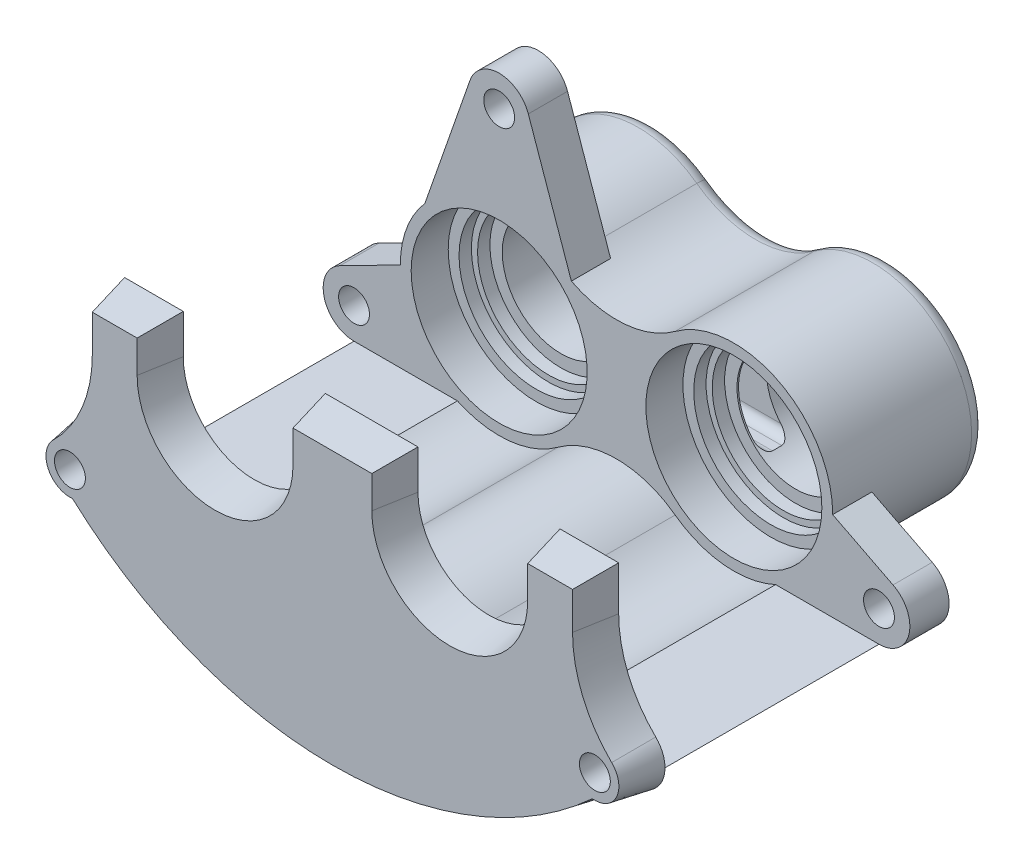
ISO-10303-21;
HEADER;
FILE_DESCRIPTION(('STEP AP214'),'2;1');
FILE_NAME('part.step','',(''),(''),'','','');
FILE_SCHEMA(('AUTOMOTIVE_DESIGN { 1 0 10303 214 1 1 1 1 }'));
ENDSEC;
DATA;
#1=APPLICATION_CONTEXT('core data for automotive mechanical design processes');
#2=APPLICATION_PROTOCOL_DEFINITION('international standard','automotive_design',2000,#1);
#3=PRODUCT_CONTEXT('',#1,'mechanical');
#4=PRODUCT('Part','Part','',(#3));
#5=PRODUCT_RELATED_PRODUCT_CATEGORY('part','',(#4));
#6=PRODUCT_DEFINITION_FORMATION('','',#4);
#7=PRODUCT_DEFINITION_CONTEXT('part definition',#1,'design');
#8=PRODUCT_DEFINITION('design','',#6,#7);
#9=PRODUCT_DEFINITION_SHAPE('','',#8);
#10=(LENGTH_UNIT() NAMED_UNIT(*) SI_UNIT(.MILLI.,.METRE.));
#11=(NAMED_UNIT(*) PLANE_ANGLE_UNIT() SI_UNIT($,.RADIAN.));
#12=(NAMED_UNIT(*) SI_UNIT($,.STERADIAN.) SOLID_ANGLE_UNIT());
#13=UNCERTAINTY_MEASURE_WITH_UNIT(LENGTH_MEASURE(1.E-05),#10,'distance_accuracy_value','');
#14=(GEOMETRIC_REPRESENTATION_CONTEXT(3) GLOBAL_UNCERTAINTY_ASSIGNED_CONTEXT((#13)) GLOBAL_UNIT_ASSIGNED_CONTEXT((#10,
#11,#12)) REPRESENTATION_CONTEXT('',''));
#15=CARTESIAN_POINT('',(0.,0.,0.));
#16=DIRECTION('',(0.,0.,1.));
#17=DIRECTION('',(1.,0.,0.));
#18=AXIS2_PLACEMENT_3D('',#15,#16,#17);
#19=CARTESIAN_POINT('',(19.,0.,12.5));
#20=DIRECTION('',(0.,0.,-1.));
#21=DIRECTION('',(-1.,0.,0.));
#22=AXIS2_PLACEMENT_3D('',#19,#20,#21);
#23=CYLINDRICAL_SURFACE('',#22,16.);
#24=DIRECTION('',(0.,0.,-1.));
#25=VECTOR('',#24,1.);
#26=CARTESIAN_POINT('',(9.5,-12.8743931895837,12.5));
#27=LINE('',#26,#25);
#28=CARTESIAN_POINT('',(9.50000000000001,-12.8743931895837,6.15));
#29=VERTEX_POINT('',#28);
#30=CARTESIAN_POINT('',(9.5,-12.8743931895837,-10.));
#31=VERTEX_POINT('',#30);
#32=EDGE_CURVE('E753',#29,#31,#27,.T.);
#33=ORIENTED_EDGE('',*,*,#32,.T.);
#34=CARTESIAN_POINT('',(19.,0.,-10.));
#35=DIRECTION('',(0.,0.,-1.));
#36=DIRECTION('',(-1.,0.,0.));
#37=AXIS2_PLACEMENT_3D('',#34,#35,#36);
#38=CIRCLE('',#37,16.);
#39=CARTESIAN_POINT('',(9.5,12.8743931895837,-10.));
#40=VERTEX_POINT('',#39);
#41=EDGE_CURVE('E11',#31,#40,#38,.F.);
#42=ORIENTED_EDGE('',*,*,#41,.T.);
#43=DIRECTION('',(0.,0.,-1.));
#44=VECTOR('',#43,1.);
#45=CARTESIAN_POINT('',(9.5,12.8743931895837,12.5));
#46=LINE('',#45,#44);
#47=CARTESIAN_POINT('',(9.5,12.8743931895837,12.5));
#48=VERTEX_POINT('',#47);
#49=EDGE_CURVE('E746',#48,#40,#46,.T.);
#50=ORIENTED_EDGE('',*,*,#49,.F.);
#51=CARTESIAN_POINT('',(19.,0.,12.5));
#52=DIRECTION('',(0.,0.,1.));
#53=DIRECTION('',(-1.,0.,0.));
#54=AXIS2_PLACEMENT_3D('',#51,#52,#53);
#55=CIRCLE('',#54,16.);
#56=CARTESIAN_POINT('',(34.9998603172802,-0.0668567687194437,12.5));
#57=VERTEX_POINT('',#56);
#58=EDGE_CURVE('E767',#57,#48,#55,.T.);
#59=ORIENTED_EDGE('',*,*,#58,.F.);
#60=DIRECTION('',(0.,0.,1.));
#61=VECTOR('',#60,1.);
#62=CARTESIAN_POINT('',(34.9998603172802,-0.0668567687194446,6.15));
#63=LINE('',#62,#61);
#64=CARTESIAN_POINT('',(34.9998603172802,-0.0668567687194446,6.15));
#65=VERTEX_POINT('',#64);
#66=EDGE_CURVE('E447',#65,#57,#63,.T.);
#67=ORIENTED_EDGE('',*,*,#66,.F.);
#68=CARTESIAN_POINT('',(19.,0.,6.15));
#69=DIRECTION('',(0.,0.,1.));
#70=DIRECTION('',(-1.,0.,0.));
#71=AXIS2_PLACEMENT_3D('',#68,#69,#70);
#72=CIRCLE('',#71,16.);
#73=EDGE_CURVE('E434',#29,#65,#72,.T.);
#74=ORIENTED_EDGE('',*,*,#73,.F.);
#75=EDGE_LOOP('',(#33,#42,#50,#59,#67,#74));
#76=FACE_BOUND('',#75,.T.);
#77=ADVANCED_FACE('F38',(#76),#23,.T.);
#78=CARTESIAN_POINT('',(0.,25.7487863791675,12.5));
#79=DIRECTION('',(0.,0.,-1.));
#80=DIRECTION('',(-1.,0.,0.));
#81=AXIS2_PLACEMENT_3D('',#78,#79,#80);
#82=CYLINDRICAL_SURFACE('',#81,16.);
#83=ORIENTED_EDGE('',*,*,#49,.T.);
#84=CARTESIAN_POINT('',(0.,25.7487863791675,-10.));
#85=DIRECTION('',(0.,0.,-1.));
#86=DIRECTION('',(-1.,0.,0.));
#87=AXIS2_PLACEMENT_3D('',#84,#85,#86);
#88=CIRCLE('',#87,16.);
#89=CARTESIAN_POINT('',(-9.5,12.8743931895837,-10.));
#90=VERTEX_POINT('',#89);
#91=EDGE_CURVE('E47',#40,#90,#88,.T.);
#92=ORIENTED_EDGE('',*,*,#91,.T.);
#93=DIRECTION('',(0.,0.,-1.));
#94=VECTOR('',#93,1.);
#95=CARTESIAN_POINT('',(-9.5,12.8743931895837,12.5));
#96=LINE('',#95,#94);
#97=CARTESIAN_POINT('',(-9.5,12.8743931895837,6.15));
#98=VERTEX_POINT('',#97);
#99=EDGE_CURVE('E748',#98,#90,#96,.T.);
#100=ORIENTED_EDGE('',*,*,#99,.F.);
#101=CARTESIAN_POINT('',(0.,25.7487863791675,6.15));
#102=DIRECTION('',(0.,0.,1.));
#103=DIRECTION('',(1.,0.,0.));
#104=AXIS2_PLACEMENT_3D('',#101,#102,#103);
#105=CIRCLE('',#104,16.);
#106=CARTESIAN_POINT('',(-7.30865370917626,11.5156004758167,6.15));
#107=VERTEX_POINT('',#106);
#108=EDGE_CURVE('E404',#98,#107,#105,.T.);
#109=ORIENTED_EDGE('',*,*,#108,.T.);
#110=DIRECTION('',(0.,0.,1.));
#111=VECTOR('',#110,1.);
#112=CARTESIAN_POINT('',(-7.30865370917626,11.5156004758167,6.15));
#113=LINE('',#112,#111);
#114=CARTESIAN_POINT('',(-7.30865370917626,11.5156004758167,12.5));
#115=VERTEX_POINT('',#114);
#116=EDGE_CURVE('E417',#107,#115,#113,.T.);
#117=ORIENTED_EDGE('',*,*,#116,.T.);
#118=CARTESIAN_POINT('',(0.,25.7487863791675,12.5));
#119=DIRECTION('',(0.,0.,-1.));
#120=DIRECTION('',(1.,0.,0.));
#121=AXIS2_PLACEMENT_3D('',#118,#119,#120);
#122=CIRCLE('',#121,16.);
#123=EDGE_CURVE('E761',#48,#115,#122,.T.);
#124=ORIENTED_EDGE('',*,*,#123,.F.);
#125=EDGE_LOOP('',(#83,#92,#100,#109,#117,#124));
#126=FACE_BOUND('',#125,.T.);
#127=ADVANCED_FACE('F692',(#126),#82,.F.);
#128=CARTESIAN_POINT('',(-19.,0.,12.5));
#129=DIRECTION('',(0.,0.,-1.));
#130=DIRECTION('',(-1.,0.,0.));
#131=AXIS2_PLACEMENT_3D('',#128,#129,#130);
#132=CYLINDRICAL_SURFACE('',#131,16.);
#133=ORIENTED_EDGE('',*,*,#99,.T.);
#134=CARTESIAN_POINT('',(-19.,0.,-10.));
#135=DIRECTION('',(0.,0.,-1.));
#136=DIRECTION('',(-1.,0.,0.));
#137=AXIS2_PLACEMENT_3D('',#134,#135,#136);
#138=CIRCLE('',#137,16.);
#139=CARTESIAN_POINT('',(-9.5,-12.8743931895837,-10.));
#140=VERTEX_POINT('',#139);
#141=EDGE_CURVE('E719',#90,#140,#138,.F.);
#142=ORIENTED_EDGE('',*,*,#141,.T.);
#143=DIRECTION('',(0.,0.,-1.));
#144=VECTOR('',#143,1.);
#145=CARTESIAN_POINT('',(-9.5,-12.8743931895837,12.5));
#146=LINE('',#145,#144);
#147=CARTESIAN_POINT('',(-9.5,-12.8743931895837,6.15));
#148=VERTEX_POINT('',#147);
#149=EDGE_CURVE('E750',#148,#140,#146,.T.);
#150=ORIENTED_EDGE('',*,*,#149,.F.);
#151=CARTESIAN_POINT('',(-19.,0.,6.15));
#152=DIRECTION('',(0.,0.,-1.));
#153=DIRECTION('',(1.,0.,0.));
#154=AXIS2_PLACEMENT_3D('',#151,#152,#153);
#155=CIRCLE('',#154,16.);
#156=CARTESIAN_POINT('',(-34.9998603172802,-0.0668567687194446,6.15));
#157=VERTEX_POINT('',#156);
#158=EDGE_CURVE('E454',#148,#157,#155,.T.);
#159=ORIENTED_EDGE('',*,*,#158,.T.);
#160=DIRECTION('',(0.,0.,1.));
#161=VECTOR('',#160,1.);
#162=CARTESIAN_POINT('',(-34.9998603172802,-0.0668567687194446,6.15));
#163=LINE('',#162,#161);
#164=CARTESIAN_POINT('',(-34.9998603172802,-0.0668567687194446,12.5));
#165=VERTEX_POINT('',#164);
#166=EDGE_CURVE('E464',#157,#165,#163,.T.);
#167=ORIENTED_EDGE('',*,*,#166,.T.);
#168=CARTESIAN_POINT('',(-19.,0.,12.5));
#169=DIRECTION('',(0.,0.,1.));
#170=DIRECTION('',(1.,0.,0.));
#171=AXIS2_PLACEMENT_3D('',#168,#169,#170);
#172=CIRCLE('',#171,16.);
#173=CARTESIAN_POINT('',(-31.0282326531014,10.5509060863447,12.5));
#174=VERTEX_POINT('',#173);
#175=EDGE_CURVE('E758',#174,#165,#172,.T.);
#176=ORIENTED_EDGE('',*,*,#175,.F.);
#177=DIRECTION('',(0.,0.,1.));
#178=VECTOR('',#177,1.);
#179=CARTESIAN_POINT('',(-31.0282326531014,10.5509060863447,6.15));
#180=LINE('',#179,#178);
#181=CARTESIAN_POINT('',(-31.0282326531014,10.5509060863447,6.15));
#182=VERTEX_POINT('',#181);
#183=EDGE_CURVE('E425',#182,#174,#180,.T.);
#184=ORIENTED_EDGE('',*,*,#183,.F.);
#185=CARTESIAN_POINT('',(-19.,0.,6.15));
#186=DIRECTION('',(0.,0.,-1.));
#187=DIRECTION('',(1.,0.,0.));
#188=AXIS2_PLACEMENT_3D('',#185,#186,#187);
#189=CIRCLE('',#188,16.);
#190=EDGE_CURVE('E401',#182,#98,#189,.T.);
#191=ORIENTED_EDGE('',*,*,#190,.T.);
#192=EDGE_LOOP('',(#133,#142,#150,#159,#167,#176,#184,#191));
#193=FACE_BOUND('',#192,.T.);
#194=ADVANCED_FACE('F697',(#193),#132,.T.);
#195=CARTESIAN_POINT('',(0.,-25.7487863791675,12.5));
#196=DIRECTION('',(0.,0.,-1.));
#197=DIRECTION('',(-1.,0.,0.));
#198=AXIS2_PLACEMENT_3D('',#195,#196,#197);
#199=CYLINDRICAL_SURFACE('',#198,16.);
#200=ORIENTED_EDGE('',*,*,#149,.T.);
#201=CARTESIAN_POINT('',(0.,-25.7487863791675,-10.));
#202=DIRECTION('',(0.,0.,-1.));
#203=DIRECTION('',(-1.,0.,0.));
#204=AXIS2_PLACEMENT_3D('',#201,#202,#203);
#205=CIRCLE('',#204,16.);
#206=EDGE_CURVE('E743',#140,#31,#205,.T.);
#207=ORIENTED_EDGE('',*,*,#206,.T.);
#208=ORIENTED_EDGE('',*,*,#32,.F.);
#209=CARTESIAN_POINT('',(0.,-25.7487863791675,6.15));
#210=DIRECTION('',(0.,0.,-1.));
#211=DIRECTION('',(-1.,0.,0.));
#212=AXIS2_PLACEMENT_3D('',#209,#210,#211);
#213=CIRCLE('',#212,16.);
#214=EDGE_CURVE('E341',#148,#29,#213,.T.);
#215=ORIENTED_EDGE('',*,*,#214,.F.);
#216=EDGE_LOOP('',(#200,#207,#208,#215));
#217=FACE_BOUND('',#216,.T.);
#218=ADVANCED_FACE('F981',(#217),#199,.F.);
#219=CARTESIAN_POINT('',(9.5,-12.8743931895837,12.5));
#220=DIRECTION('',(0.,0.,-1.));
#221=DIRECTION('',(-1.,0.,0.));
#222=AXIS2_PLACEMENT_3D('',#219,#220,#221);
#223=PLANE('',#222);
#224=CARTESIAN_POINT('',(-42.5,-9.5,12.5));
#225=DIRECTION('',(0.,0.,-1.));
#226=DIRECTION('',(-1.,0.,0.));
#227=AXIS2_PLACEMENT_3D('',#224,#225,#226);
#228=CIRCLE('',#227,2.5);
#229=CARTESIAN_POINT('',(-45.,-9.5,12.5));
#230=VERTEX_POINT('',#229);
#231=EDGE_CURVE('E1141',#230,#230,#228,.F.);
#232=ORIENTED_EDGE('',*,*,#231,.F.);
#233=EDGE_LOOP('',(#232));
#234=FACE_BOUND('',#233,.T.);
#235=CARTESIAN_POINT('',(42.5,-9.5,12.5));
#236=DIRECTION('',(0.,0.,-1.));
#237=DIRECTION('',(-1.,0.,0.));
#238=AXIS2_PLACEMENT_3D('',#235,#236,#237);
#239=CIRCLE('',#238,2.5);
#240=CARTESIAN_POINT('',(40.,-9.5,12.5));
#241=VERTEX_POINT('',#240);
#242=EDGE_CURVE('E331',#241,#241,#239,.T.);
#243=ORIENTED_EDGE('',*,*,#242,.T.);
#244=EDGE_LOOP('',(#243));
#245=FACE_BOUND('',#244,.T.);
#246=DIRECTION('',(-0.329690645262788,-0.944089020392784,0.));
#247=VECTOR('',#246,1.);
#248=CARTESIAN_POINT('',(-31.0282326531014,10.5509060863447,12.5));
#249=LINE('',#248,#247);
#250=CARTESIAN_POINT('',(-23.7204451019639,31.4771958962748,12.5));
#251=VERTEX_POINT('',#250);
#252=EDGE_CURVE('E405',#251,#174,#249,.T.);
#253=ORIENTED_EDGE('',*,*,#252,.T.);
#254=ORIENTED_EDGE('',*,*,#175,.T.);
#255=DIRECTION('',(-0.891006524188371,-0.453990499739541,0.));
#256=VECTOR('',#255,1.);
#257=CARTESIAN_POINT('',(-34.9998603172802,-0.0668567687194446,12.5));
#258=LINE('',#257,#256);
#259=CARTESIAN_POINT('',(-44.7699524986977,-5.04496737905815,12.5));
#260=VERTEX_POINT('',#259);
#261=EDGE_CURVE('E449',#165,#260,#258,.T.);
#262=ORIENTED_EDGE('',*,*,#261,.T.);
#263=CARTESIAN_POINT('',(-42.5,-9.5,12.5));
#264=DIRECTION('',(0.,0.,1.));
#265=DIRECTION('',(1.,0.,0.));
#266=AXIS2_PLACEMENT_3D('',#263,#264,#265);
#267=CIRCLE('',#266,5.);
#268=CARTESIAN_POINT('',(-42.5,-14.5,12.5));
#269=VERTEX_POINT('',#268);
#270=EDGE_CURVE('E467',#260,#269,#267,.T.);
#271=ORIENTED_EDGE('',*,*,#270,.T.);
#272=DIRECTION('',(1.,0.,0.));
#273=VECTOR('',#272,1.);
#274=CARTESIAN_POINT('',(-42.5,-14.5,12.5));
#275=LINE('',#274,#273);
#276=CARTESIAN_POINT('',(-25.7638746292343,-14.5,12.5));
#277=VERTEX_POINT('',#276);
#278=EDGE_CURVE('E458',#269,#277,#275,.T.);
#279=ORIENTED_EDGE('',*,*,#278,.T.);
#280=CARTESIAN_POINT('',(-9.5,-12.8743931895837,12.5));
#281=VERTEX_POINT('',#280);
#282=EDGE_CURVE('E760',#277,#281,#172,.T.);
#283=ORIENTED_EDGE('',*,*,#282,.T.);
#284=CARTESIAN_POINT('',(0.,-25.7487863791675,12.5));
#285=DIRECTION('',(0.,0.,-1.));
#286=DIRECTION('',(-1.,0.,0.));
#287=AXIS2_PLACEMENT_3D('',#284,#285,#286);
#288=CIRCLE('',#287,16.);
#289=CARTESIAN_POINT('',(9.50000000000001,-12.8743931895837,12.5));
#290=VERTEX_POINT('',#289);
#291=EDGE_CURVE('E755',#281,#290,#288,.T.);
#292=ORIENTED_EDGE('',*,*,#291,.T.);
#293=CARTESIAN_POINT('',(25.7638746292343,-14.5,12.5));
#294=VERTEX_POINT('',#293);
#295=EDGE_CURVE('E764',#290,#294,#55,.T.);
#296=ORIENTED_EDGE('',*,*,#295,.T.);
#297=DIRECTION('',(-1.,0.,0.));
#298=VECTOR('',#297,1.);
#299=CARTESIAN_POINT('',(42.5,-14.5,12.5));
#300=LINE('',#299,#298);
#301=CARTESIAN_POINT('',(42.5,-14.5,12.5));
#302=VERTEX_POINT('',#301);
#303=EDGE_CURVE('E427',#302,#294,#300,.T.);
#304=ORIENTED_EDGE('',*,*,#303,.F.);
#305=CARTESIAN_POINT('',(42.5,-9.5,12.5));
#306=DIRECTION('',(0.,0.,-1.));
#307=DIRECTION('',(-1.,0.,0.));
#308=AXIS2_PLACEMENT_3D('',#305,#306,#307);
#309=CIRCLE('',#308,5.);
#310=CARTESIAN_POINT('',(44.7699524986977,-5.04496737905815,12.5));
#311=VERTEX_POINT('',#310);
#312=EDGE_CURVE('E444',#311,#302,#309,.T.);
#313=ORIENTED_EDGE('',*,*,#312,.F.);
#314=DIRECTION('',(0.891006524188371,-0.453990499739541,0.));
#315=VECTOR('',#314,1.);
#316=CARTESIAN_POINT('',(34.9998603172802,-0.0668567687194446,12.5));
#317=LINE('',#316,#315);
#318=EDGE_CURVE('E438',#57,#311,#317,.T.);
#319=ORIENTED_EDGE('',*,*,#318,.F.);
#320=ORIENTED_EDGE('',*,*,#58,.T.);
#321=ORIENTED_EDGE('',*,*,#123,.T.);
#322=DIRECTION('',(-0.329690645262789,0.944089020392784,0.));
#323=VECTOR('',#322,1.);
#324=CARTESIAN_POINT('',(-7.30865370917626,11.5156004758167,12.5));
#325=LINE('',#324,#323);
#326=CARTESIAN_POINT('',(-14.2795548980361,31.4771958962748,12.5));
#327=VERTEX_POINT('',#326);
#328=EDGE_CURVE('E398',#115,#327,#325,.T.);
#329=ORIENTED_EDGE('',*,*,#328,.T.);
#330=CARTESIAN_POINT('',(-19.,29.8287426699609,12.5));
#331=DIRECTION('',(0.,0.,1.));
#332=DIRECTION('',(1.,0.,0.));
#333=AXIS2_PLACEMENT_3D('',#330,#331,#332);
#334=CIRCLE('',#333,4.99999999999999);
#335=EDGE_CURVE('E420',#327,#251,#334,.T.);
#336=ORIENTED_EDGE('',*,*,#335,.T.);
#337=EDGE_LOOP('',(#253,#254,#262,#271,#279,#283,#292,#296,#304,#313,#319,#320,#321,#329,#336));
#338=FACE_BOUND('',#337,.T.);
#339=CARTESIAN_POINT('',(-19.,0.,12.5));
#340=DIRECTION('',(0.,0.,-1.));
#341=DIRECTION('',(-1.,0.,0.));
#342=AXIS2_PLACEMENT_3D('',#339,#340,#341);
#343=CIRCLE('',#342,14.25);
#344=CARTESIAN_POINT('',(-33.25,0.,12.5));
#345=VERTEX_POINT('',#344);
#346=EDGE_CURVE('E798',#345,#345,#343,.T.);
#347=ORIENTED_EDGE('',*,*,#346,.T.);
#348=EDGE_LOOP('',(#347));
#349=FACE_BOUND('',#348,.T.);
#350=CARTESIAN_POINT('',(19.,0.,12.5));
#351=DIRECTION('',(0.,0.,1.));
#352=DIRECTION('',(1.,0.,0.));
#353=AXIS2_PLACEMENT_3D('',#350,#351,#352);
#354=CIRCLE('',#353,14.25);
#355=CARTESIAN_POINT('',(33.25,0.,12.5));
#356=VERTEX_POINT('',#355);
#357=EDGE_CURVE('E768',#356,#356,#354,.T.);
#358=ORIENTED_EDGE('',*,*,#357,.F.);
#359=EDGE_LOOP('',(#358));
#360=FACE_BOUND('',#359,.T.);
#361=CARTESIAN_POINT('',(-19.,29.8287426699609,12.5));
#362=DIRECTION('',(0.,0.,1.));
#363=DIRECTION('',(1.,0.,0.));
#364=AXIS2_PLACEMENT_3D('',#361,#362,#363);
#365=CIRCLE('',#364,2.5);
#366=CARTESIAN_POINT('',(-16.5,29.8287426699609,12.5));
#367=VERTEX_POINT('',#366);
#368=EDGE_CURVE('E387',#367,#367,#365,.T.);
#369=ORIENTED_EDGE('',*,*,#368,.F.);
#370=EDGE_LOOP('',(#369));
#371=FACE_BOUND('',#370,.T.);
#372=ADVANCED_FACE('F978',(#234,#245,#338,#349,#360,#371),#223,.F.);
#373=CARTESIAN_POINT('',(9.5,-12.8743931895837,-12.5));
#374=DIRECTION('',(0.,0.,-1.));
#375=DIRECTION('',(-1.,0.,0.));
#376=AXIS2_PLACEMENT_3D('',#373,#374,#375);
#377=PLANE('',#376);
#378=CARTESIAN_POINT('',(19.,0.,-12.5));
#379=DIRECTION('',(0.,0.,-1.));
#380=DIRECTION('',(-1.,0.,0.));
#381=AXIS2_PLACEMENT_3D('',#378,#379,#380);
#382=CIRCLE('',#381,13.5);
#383=CARTESIAN_POINT('',(10.984375,10.8627692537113,-12.5));
#384=VERTEX_POINT('',#383);
#385=CARTESIAN_POINT('',(10.984375,-10.8627692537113,-12.5));
#386=VERTEX_POINT('',#385);
#387=EDGE_CURVE('E741',#384,#386,#382,.T.);
#388=ORIENTED_EDGE('',*,*,#387,.T.);
#389=CARTESIAN_POINT('',(0.,-25.7487863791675,-12.5));
#390=DIRECTION('',(0.,0.,-1.));
#391=DIRECTION('',(-1.,0.,0.));
#392=AXIS2_PLACEMENT_3D('',#389,#390,#391);
#393=CIRCLE('',#392,18.5);
#394=CARTESIAN_POINT('',(-10.984375,-10.8627692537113,-12.5));
#395=VERTEX_POINT('',#394);
#396=EDGE_CURVE('E736',#386,#395,#393,.F.);
#397=ORIENTED_EDGE('',*,*,#396,.T.);
#398=CARTESIAN_POINT('',(-19.,0.,-12.5));
#399=DIRECTION('',(0.,0.,-1.));
#400=DIRECTION('',(-1.,0.,0.));
#401=AXIS2_PLACEMENT_3D('',#398,#399,#400);
#402=CIRCLE('',#401,13.5);
#403=CARTESIAN_POINT('',(-10.984375,10.8627692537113,-12.5));
#404=VERTEX_POINT('',#403);
#405=EDGE_CURVE('E717',#395,#404,#402,.T.);
#406=ORIENTED_EDGE('',*,*,#405,.T.);
#407=CARTESIAN_POINT('',(0.,25.7487863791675,-12.5));
#408=DIRECTION('',(0.,0.,-1.));
#409=DIRECTION('',(-1.,0.,0.));
#410=AXIS2_PLACEMENT_3D('',#407,#408,#409);
#411=CIRCLE('',#410,18.5);
#412=EDGE_CURVE('E739',#404,#384,#411,.F.);
#413=ORIENTED_EDGE('',*,*,#412,.T.);
#414=EDGE_LOOP('',(#388,#397,#406,#413));
#415=FACE_BOUND('',#414,.T.);
#416=ADVANCED_FACE('F976',(#415),#377,.T.);
#417=CARTESIAN_POINT('',(19.,0.,18.0558250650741));
#418=DIRECTION('',(0.,0.,1.));
#419=DIRECTION('',(1.,0.,0.));
#420=AXIS2_PLACEMENT_3D('',#417,#418,#419);
#421=CYLINDRICAL_SURFACE('',#420,14.25);
#422=ORIENTED_EDGE('',*,*,#357,.T.);
#423=EDGE_LOOP('',(#422));
#424=FACE_BOUND('',#423,.T.);
#425=CARTESIAN_POINT('',(19.,0.,6.5));
#426=DIRECTION('',(0.,0.,1.));
#427=DIRECTION('',(1.,0.,0.));
#428=AXIS2_PLACEMENT_3D('',#425,#426,#427);
#429=CIRCLE('',#428,14.25);
#430=CARTESIAN_POINT('',(33.25,0.,6.5));
#431=VERTEX_POINT('',#430);
#432=EDGE_CURVE('E771',#431,#431,#429,.T.);
#433=ORIENTED_EDGE('',*,*,#432,.F.);
#434=EDGE_LOOP('',(#433));
#435=FACE_BOUND('',#434,.T.);
#436=ADVANCED_FACE('F972',(#424,#435),#421,.F.);
#437=CARTESIAN_POINT('',(19.,14.25,6.5));
#438=DIRECTION('',(0.,0.,1.));
#439=DIRECTION('',(1.,0.,0.));
#440=AXIS2_PLACEMENT_3D('',#437,#438,#439);
#441=PLANE('',#440);
#442=ORIENTED_EDGE('',*,*,#432,.T.);
#443=EDGE_LOOP('',(#442));
#444=FACE_BOUND('',#443,.T.);
#445=CARTESIAN_POINT('',(19.,0.,6.5));
#446=DIRECTION('',(0.,0.,1.));
#447=DIRECTION('',(1.,0.,0.));
#448=AXIS2_PLACEMENT_3D('',#445,#446,#447);
#449=CIRCLE('',#448,12.5);
#450=CARTESIAN_POINT('',(31.5,0.,6.5));
#451=VERTEX_POINT('',#450);
#452=EDGE_CURVE('E774',#451,#451,#449,.T.);
#453=ORIENTED_EDGE('',*,*,#452,.F.);
#454=EDGE_LOOP('',(#453));
#455=FACE_BOUND('',#454,.T.);
#456=ADVANCED_FACE('F968',(#444,#455),#441,.T.);
#457=CARTESIAN_POINT('',(19.,0.,18.0558250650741));
#458=DIRECTION('',(0.,0.,1.));
#459=DIRECTION('',(1.,0.,0.));
#460=AXIS2_PLACEMENT_3D('',#457,#458,#459);
#461=CYLINDRICAL_SURFACE('',#460,12.5);
#462=ORIENTED_EDGE('',*,*,#452,.T.);
#463=EDGE_LOOP('',(#462));
#464=FACE_BOUND('',#463,.T.);
#465=CARTESIAN_POINT('',(19.,0.,4.5));
#466=DIRECTION('',(0.,0.,1.));
#467=DIRECTION('',(1.,0.,0.));
#468=AXIS2_PLACEMENT_3D('',#465,#466,#467);
#469=CIRCLE('',#468,12.5);
#470=CARTESIAN_POINT('',(31.5,0.,4.5));
#471=VERTEX_POINT('',#470);
#472=EDGE_CURVE('E777',#471,#471,#469,.T.);
#473=ORIENTED_EDGE('',*,*,#472,.F.);
#474=EDGE_LOOP('',(#473));
#475=FACE_BOUND('',#474,.T.);
#476=ADVANCED_FACE('F964',(#464,#475),#461,.F.);
#477=CARTESIAN_POINT('',(19.,12.5,4.5));
#478=DIRECTION('',(0.,0.,1.));
#479=DIRECTION('',(1.,0.,0.));
#480=AXIS2_PLACEMENT_3D('',#477,#478,#479);
#481=PLANE('',#480);
#482=ORIENTED_EDGE('',*,*,#472,.T.);
#483=EDGE_LOOP('',(#482));
#484=FACE_BOUND('',#483,.T.);
#485=CARTESIAN_POINT('',(19.,0.,4.5));
#486=DIRECTION('',(0.,0.,1.));
#487=DIRECTION('',(1.,0.,0.));
#488=AXIS2_PLACEMENT_3D('',#485,#486,#487);
#489=CIRCLE('',#488,11.5);
#490=CARTESIAN_POINT('',(30.5,0.,4.5));
#491=VERTEX_POINT('',#490);
#492=EDGE_CURVE('E780',#491,#491,#489,.T.);
#493=ORIENTED_EDGE('',*,*,#492,.F.);
#494=EDGE_LOOP('',(#493));
#495=FACE_BOUND('',#494,.T.);
#496=ADVANCED_FACE('F960',(#484,#495),#481,.T.);
#497=CARTESIAN_POINT('',(19.,0.,18.0558250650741));
#498=DIRECTION('',(0.,0.,1.));
#499=DIRECTION('',(1.,0.,0.));
#500=AXIS2_PLACEMENT_3D('',#497,#498,#499);
#501=CYLINDRICAL_SURFACE('',#500,11.5);
#502=ORIENTED_EDGE('',*,*,#492,.T.);
#503=EDGE_LOOP('',(#502));
#504=FACE_BOUND('',#503,.T.);
#505=CARTESIAN_POINT('',(19.,0.,2.5));
#506=DIRECTION('',(0.,0.,1.));
#507=DIRECTION('',(1.,0.,0.));
#508=AXIS2_PLACEMENT_3D('',#505,#506,#507);
#509=CIRCLE('',#508,11.5);
#510=CARTESIAN_POINT('',(30.5,0.,2.5));
#511=VERTEX_POINT('',#510);
#512=EDGE_CURVE('E783',#511,#511,#509,.T.);
#513=ORIENTED_EDGE('',*,*,#512,.F.);
#514=EDGE_LOOP('',(#513));
#515=FACE_BOUND('',#514,.T.);
#516=ADVANCED_FACE('F956',(#504,#515),#501,.F.);
#517=CARTESIAN_POINT('',(19.,11.5,2.5));
#518=DIRECTION('',(0.,0.,1.));
#519=DIRECTION('',(1.,0.,0.));
#520=AXIS2_PLACEMENT_3D('',#517,#518,#519);
#521=PLANE('',#520);
#522=ORIENTED_EDGE('',*,*,#512,.T.);
#523=EDGE_LOOP('',(#522));
#524=FACE_BOUND('',#523,.T.);
#525=CARTESIAN_POINT('',(19.,0.,2.5));
#526=DIRECTION('',(0.,0.,1.));
#527=DIRECTION('',(1.,0.,0.));
#528=AXIS2_PLACEMENT_3D('',#525,#526,#527);
#529=CIRCLE('',#528,9.5);
#530=CARTESIAN_POINT('',(28.5,0.,2.5));
#531=VERTEX_POINT('',#530);
#532=EDGE_CURVE('E786',#531,#531,#529,.T.);
#533=ORIENTED_EDGE('',*,*,#532,.F.);
#534=EDGE_LOOP('',(#533));
#535=FACE_BOUND('',#534,.T.);
#536=ADVANCED_FACE('F952',(#524,#535),#521,.T.);
#537=CARTESIAN_POINT('',(19.,0.,18.0558250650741));
#538=DIRECTION('',(0.,0.,1.));
#539=DIRECTION('',(1.,0.,0.));
#540=AXIS2_PLACEMENT_3D('',#537,#538,#539);
#541=CYLINDRICAL_SURFACE('',#540,9.5);
#542=CARTESIAN_POINT('',(19.,0.,-2.25));
#543=DIRECTION('',(0.,0.,1.));
#544=DIRECTION('',(0.,-1.,0.));
#545=AXIS2_PLACEMENT_3D('',#542,#543,#544);
#546=CIRCLE('',#545,9.5);
#547=CARTESIAN_POINT('',(11.8454559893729,-6.25,-2.25));
#548=VERTEX_POINT('',#547);
#549=CARTESIAN_POINT('',(11.8454559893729,6.25000000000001,-2.25));
#550=VERTEX_POINT('',#549);
#551=EDGE_CURVE('E489',#548,#550,#546,.F.);
#552=ORIENTED_EDGE('',*,*,#551,.F.);
#553=CARTESIAN_POINT('',(13.505684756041,-7.74999999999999,-0.75));
#554=CARTESIAN_POINT('',(13.5056912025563,-7.75000366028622,-0.776195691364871));
#555=CARTESIAN_POINT('',(13.5047161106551,-7.74931335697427,-0.802377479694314));
#556=CARTESIAN_POINT('',(13.5008657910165,-7.74658192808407,-0.854502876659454));
#557=CARTESIAN_POINT('',(13.4979925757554,-7.74454223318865,-0.880446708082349));
#558=CARTESIAN_POINT('',(13.4867009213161,-7.73651220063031,-0.957118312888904));
#559=CARTESIAN_POINT('',(13.4756074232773,-7.7286090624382,-1.00727492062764));
#560=CARTESIAN_POINT('',(13.4438335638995,-7.70580787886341,-1.11670256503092));
#561=CARTESIAN_POINT('',(13.4214751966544,-7.68967414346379,-1.17521406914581));
#562=CARTESIAN_POINT('',(13.3695902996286,-7.65176605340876,-1.28718801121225));
#563=CARTESIAN_POINT('',(13.3400316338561,-7.62996638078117,-1.34062627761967));
#564=CARTESIAN_POINT('',(13.2595344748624,-7.5697211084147,-1.4680035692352));
#565=CARTESIAN_POINT('',(13.2053700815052,-7.52844955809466,-1.53853909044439));
#566=CARTESIAN_POINT('',(13.0903592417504,-7.43851566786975,-1.66852934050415));
#567=CARTESIAN_POINT('',(13.0294985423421,-7.38983747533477,-1.72795967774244));
#568=CARTESIAN_POINT('',(12.9194621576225,-7.29937100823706,-1.82331198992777));
#569=CARTESIAN_POINT('',(12.8711076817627,-7.25884546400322,-1.86141653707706));
#570=CARTESIAN_POINT('',(12.7729950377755,-7.17485823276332,-1.93222467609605));
#571=CARTESIAN_POINT('',(12.7232362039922,-7.13139513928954,-1.96492565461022));
#572=CARTESIAN_POINT('',(12.5727943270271,-6.99707248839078,-2.05519739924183));
#573=CARTESIAN_POINT('',(12.4708849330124,-6.90222996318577,-2.10498784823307));
#574=CARTESIAN_POINT('',(12.2802544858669,-6.71643369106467,-2.17867472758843));
#575=CARTESIAN_POINT('',(12.1914868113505,-6.62649118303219,-2.20504032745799));
#576=CARTESIAN_POINT('',(12.0600766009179,-6.48779722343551,-2.23177554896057));
#577=CARTESIAN_POINT('',(12.0166213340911,-6.44100206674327,-2.23855121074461));
#578=CARTESIAN_POINT('',(11.9304371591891,-6.34628986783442,-2.24766099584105));
#579=CARTESIAN_POINT('',(11.8877085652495,-6.29837236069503,-2.24999324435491));
#580=CARTESIAN_POINT('',(11.8454559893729,-6.25,-2.25));
#581=B_SPLINE_CURVE_WITH_KNOTS('',3,(#553,#554,#555,#556,#557,#558,#559,#560,#561,#562,#563,
#564,#565,#566,#567,#568,#569,#570,#571,#572,#573,#574,#575,#576,#577,#578,#579,#580),
.UNSPECIFIED.,.F.,.F.,(4,2,2,2,2,2,2,2,2,2,2,2,2,4),(0.,0.0785342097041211,0.156985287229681,
0.31214641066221,0.505139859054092,0.699010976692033,0.991525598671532,1.28467534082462,
1.50550718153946,1.72644551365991,2.16804458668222,2.55410147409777,2.74660702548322,
2.93919378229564),.UNSPECIFIED.);
#582=CARTESIAN_POINT('',(13.505684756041,-7.74999999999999,-0.749999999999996));
#583=VERTEX_POINT('',#582);
#584=EDGE_CURVE('E480',#583,#548,#581,.T.);
#585=ORIENTED_EDGE('',*,*,#584,.F.);
#586=DIRECTION('',(0.,0.,1.));
#587=VECTOR('',#586,1.);
#588=CARTESIAN_POINT('',(13.505684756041,-7.74999999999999,18.0558250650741));
#589=LINE('',#588,#587);
#590=CARTESIAN_POINT('',(13.505684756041,-7.74999999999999,0.750000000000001));
#591=VERTEX_POINT('',#590);
#592=EDGE_CURVE('E475',#591,#583,#589,.F.);
#593=ORIENTED_EDGE('',*,*,#592,.F.);
#594=CARTESIAN_POINT('',(11.8454559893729,-6.25,2.25));
#595=CARTESIAN_POINT('',(11.887042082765,-6.29760747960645,2.24999252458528));
#596=CARTESIAN_POINT('',(11.9290810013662,-6.34476787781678,2.24773422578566));
#597=CARTESIAN_POINT('',(12.0138655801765,-6.43800369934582,2.23890941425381));
#598=CARTESIAN_POINT('',(12.0566109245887,-6.48407958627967,2.23234477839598));
#599=CARTESIAN_POINT('',(12.1860646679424,-6.62088013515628,2.20639778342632));
#600=CARTESIAN_POINT('',(12.2735998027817,-6.7097306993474,2.1807658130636));
#601=CARTESIAN_POINT('',(12.4143870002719,-6.8472814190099,2.12708566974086));
#602=CARTESIAN_POINT('',(12.4675929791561,-6.89803813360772,2.10394564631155));
#603=CARTESIAN_POINT('',(12.5736493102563,-6.99694652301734,2.05199445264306));
#604=CARTESIAN_POINT('',(12.6264997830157,-7.04509912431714,2.02318531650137));
#605=CARTESIAN_POINT('',(12.7312405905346,-7.13845725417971,1.95988494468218));
#606=CARTESIAN_POINT('',(12.7831321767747,-7.18366685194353,1.92540179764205));
#607=CARTESIAN_POINT('',(12.8853124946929,-7.2708391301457,1.85053896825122));
#608=CARTESIAN_POINT('',(12.9356022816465,-7.3128039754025,1.8101632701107));
#609=CARTESIAN_POINT('',(13.0394242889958,-7.39773875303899,1.71802559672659));
#610=CARTESIAN_POINT('',(13.0926472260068,-7.44025158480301,1.66548407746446));
#611=CARTESIAN_POINT('',(13.19400249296,-7.51960888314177,1.5518063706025));
#612=CARTESIAN_POINT('',(13.2421389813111,-7.55645799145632,1.49067730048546));
#613=CARTESIAN_POINT('',(13.3197154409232,-7.61486331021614,1.37473591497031));
#614=CARTESIAN_POINT('',(13.3508790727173,-7.63797223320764,1.32187992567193));
#615=CARTESIAN_POINT('',(13.4063006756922,-7.67865248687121,1.21089560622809));
#616=CARTESIAN_POINT('',(13.4305888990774,-7.69624811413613,1.15279190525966));
#617=CARTESIAN_POINT('',(13.4678383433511,-7.72306076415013,1.03835501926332));
#618=CARTESIAN_POINT('',(13.4817380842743,-7.73297631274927,0.982505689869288));
#619=CARTESIAN_POINT('',(13.4959494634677,-7.74309114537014,0.896721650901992));
#620=CARTESIAN_POINT('',(13.4995817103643,-7.74567057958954,0.867587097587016));
#621=CARTESIAN_POINT('',(13.5044562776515,-7.74912917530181,0.808975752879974));
#622=CARTESIAN_POINT('',(13.5056949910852,-7.75000577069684,0.779498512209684));
#623=CARTESIAN_POINT('',(13.505684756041,-7.74999999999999,0.75));
#624=B_SPLINE_CURVE_WITH_KNOTS('',3,(#594,#595,#596,#597,#598,#599,#600,#601,#602,#603,#604,
#605,#606,#607,#608,#609,#610,#611,#612,#613,#614,#615,#616,#617,#618,#619,#620,#621,#622,#623),
.UNSPECIFIED.,.F.,.F.,(4,2,2,2,2,2,2,2,2,2,2,2,2,2,4),(0.,0.189526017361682,0.378969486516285,
0.759623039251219,0.990683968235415,1.22166214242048,1.45231385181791,1.68281032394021,
1.94028113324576,2.19753979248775,2.39360344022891,2.58879048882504,2.76294538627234,
2.85123033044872,2.93964821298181),.UNSPECIFIED.);
#625=CARTESIAN_POINT('',(11.8454559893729,-6.25,2.25));
#626=VERTEX_POINT('',#625);
#627=EDGE_CURVE('E500',#626,#591,#624,.T.);
#628=ORIENTED_EDGE('',*,*,#627,.F.);
#629=CARTESIAN_POINT('',(19.,0.,2.25));
#630=DIRECTION('',(0.,0.,-1.));
#631=DIRECTION('',(0.,1.,0.));
#632=AXIS2_PLACEMENT_3D('',#629,#630,#631);
#633=CIRCLE('',#632,9.5);
#634=CARTESIAN_POINT('',(11.8454559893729,6.25000000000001,2.25));
#635=VERTEX_POINT('',#634);
#636=EDGE_CURVE('E1676',#635,#626,#633,.F.);
#637=ORIENTED_EDGE('',*,*,#636,.F.);
#638=CARTESIAN_POINT('',(13.505684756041,7.75000000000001,0.750000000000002));
#639=CARTESIAN_POINT('',(13.5056912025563,7.75000366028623,0.776195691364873));
#640=CARTESIAN_POINT('',(13.5047161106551,7.74931335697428,0.802377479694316));
#641=CARTESIAN_POINT('',(13.5008657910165,7.74658192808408,0.854502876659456));
#642=CARTESIAN_POINT('',(13.4979925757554,7.74454223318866,0.880446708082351));
#643=CARTESIAN_POINT('',(13.4867009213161,7.73651220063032,0.957118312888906));
#644=CARTESIAN_POINT('',(13.4756074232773,7.72860906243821,1.00727492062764));
#645=CARTESIAN_POINT('',(13.4438335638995,7.70580787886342,1.11670256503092));
#646=CARTESIAN_POINT('',(13.4214751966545,7.6896741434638,1.17521406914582));
#647=CARTESIAN_POINT('',(13.3695902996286,7.65176605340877,1.28718801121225));
#648=CARTESIAN_POINT('',(13.3400316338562,7.62996638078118,1.34062627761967));
#649=CARTESIAN_POINT('',(13.2595344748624,7.56972110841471,1.4680035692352));
#650=CARTESIAN_POINT('',(13.2053700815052,7.52844955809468,1.53853909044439));
#651=CARTESIAN_POINT('',(13.0903592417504,7.43851566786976,1.66852934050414));
#652=CARTESIAN_POINT('',(13.0294985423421,7.38983747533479,1.72795967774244));
#653=CARTESIAN_POINT('',(12.9194621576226,7.29937100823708,1.82331198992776));
#654=CARTESIAN_POINT('',(12.8711076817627,7.25884546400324,1.86141653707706));
#655=CARTESIAN_POINT('',(12.7729950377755,7.17485823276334,1.93222467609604));
#656=CARTESIAN_POINT('',(12.7232362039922,7.13139513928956,1.96492565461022));
#657=CARTESIAN_POINT('',(12.5727943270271,6.99707248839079,2.05519739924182));
#658=CARTESIAN_POINT('',(12.4708849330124,6.90222996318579,2.10498784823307));
#659=CARTESIAN_POINT('',(12.2802544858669,6.71643369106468,2.17867472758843));
#660=CARTESIAN_POINT('',(12.1914868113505,6.6264911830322,2.205040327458));
#661=CARTESIAN_POINT('',(12.0600766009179,6.48779722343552,2.23177554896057));
#662=CARTESIAN_POINT('',(12.0166213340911,6.44100206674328,2.23855121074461));
#663=CARTESIAN_POINT('',(11.9304371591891,6.34628986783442,2.24766099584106));
#664=CARTESIAN_POINT('',(11.8877085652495,6.29837236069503,2.24999324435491));
#665=CARTESIAN_POINT('',(11.8454559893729,6.25000000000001,2.25));
#666=B_SPLINE_CURVE_WITH_KNOTS('',3,(#638,#639,#640,#641,#642,#643,#644,#645,#646,#647,#648,
#649,#650,#651,#652,#653,#654,#655,#656,#657,#658,#659,#660,#661,#662,#663,#664,#665),
.UNSPECIFIED.,.F.,.F.,(4,2,2,2,2,2,2,2,2,2,2,2,2,4),(0.,0.0785342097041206,0.15698528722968,
0.312146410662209,0.505139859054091,0.699010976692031,0.991525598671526,1.28467534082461,
1.50550718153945,1.72644551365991,2.16804458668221,2.55410147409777,2.74660702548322,
2.93919378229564),.UNSPECIFIED.);
#667=CARTESIAN_POINT('',(13.505684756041,7.75000000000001,0.750000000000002));
#668=VERTEX_POINT('',#667);
#669=EDGE_CURVE('E510',#668,#635,#666,.T.);
#670=ORIENTED_EDGE('',*,*,#669,.F.);
#671=DIRECTION('',(0.,0.,1.));
#672=VECTOR('',#671,1.);
#673=CARTESIAN_POINT('',(13.505684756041,7.74999999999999,18.0558250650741));
#674=LINE('',#673,#672);
#675=CARTESIAN_POINT('',(13.505684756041,7.75000000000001,-0.749999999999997));
#676=VERTEX_POINT('',#675);
#677=EDGE_CURVE('E523',#676,#668,#674,.T.);
#678=ORIENTED_EDGE('',*,*,#677,.F.);
#679=CARTESIAN_POINT('',(11.8454559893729,6.25000000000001,-2.25));
#680=CARTESIAN_POINT('',(11.887042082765,6.29760747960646,-2.24999252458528));
#681=CARTESIAN_POINT('',(11.9290810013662,6.34476787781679,-2.24773422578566));
#682=CARTESIAN_POINT('',(12.0138655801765,6.43800369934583,-2.23890941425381));
#683=CARTESIAN_POINT('',(12.0566109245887,6.48407958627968,-2.23234477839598));
#684=CARTESIAN_POINT('',(12.1860646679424,6.62088013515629,-2.20639778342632));
#685=CARTESIAN_POINT('',(12.2735998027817,6.70973069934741,-2.1807658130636));
#686=CARTESIAN_POINT('',(12.4143870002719,6.84728141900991,-2.12708566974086));
#687=CARTESIAN_POINT('',(12.4675929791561,6.89803813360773,-2.10394564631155));
#688=CARTESIAN_POINT('',(12.5736493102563,6.99694652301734,-2.05199445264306));
#689=CARTESIAN_POINT('',(12.6264997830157,7.04509912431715,-2.02318531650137));
#690=CARTESIAN_POINT('',(12.7312405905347,7.13845725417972,-1.95988494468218));
#691=CARTESIAN_POINT('',(12.7831321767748,7.18366685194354,-1.92540179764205));
#692=CARTESIAN_POINT('',(12.8853124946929,7.27083913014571,-1.85053896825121));
#693=CARTESIAN_POINT('',(12.9356022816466,7.31280397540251,-1.8101632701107));
#694=CARTESIAN_POINT('',(13.0394242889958,7.397738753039,-1.71802559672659));
#695=CARTESIAN_POINT('',(13.0926472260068,7.44025158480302,-1.66548407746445));
#696=CARTESIAN_POINT('',(13.19400249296,7.51960888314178,-1.5518063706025));
#697=CARTESIAN_POINT('',(13.2421389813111,7.55645799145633,-1.49067730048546));
#698=CARTESIAN_POINT('',(13.3197154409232,7.61486331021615,-1.37473591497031));
#699=CARTESIAN_POINT('',(13.3508790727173,7.63797223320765,-1.32187992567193));
#700=CARTESIAN_POINT('',(13.4063006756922,7.67865248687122,-1.21089560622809));
#701=CARTESIAN_POINT('',(13.4305888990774,7.69624811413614,-1.15279190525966));
#702=CARTESIAN_POINT('',(13.4678383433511,7.72306076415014,-1.03835501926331));
#703=CARTESIAN_POINT('',(13.4817380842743,7.73297631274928,-0.982505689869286));
#704=CARTESIAN_POINT('',(13.4959494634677,7.74309114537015,-0.89672165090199));
#705=CARTESIAN_POINT('',(13.4995817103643,7.74567057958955,-0.867587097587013));
#706=CARTESIAN_POINT('',(13.5044562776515,7.74912917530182,-0.808975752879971));
#707=CARTESIAN_POINT('',(13.5056949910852,7.75000577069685,-0.779498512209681));
#708=CARTESIAN_POINT('',(13.505684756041,7.75000000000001,-0.749999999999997));
#709=B_SPLINE_CURVE_WITH_KNOTS('',3,(#679,#680,#681,#682,#683,#684,#685,#686,#687,#688,#689,
#690,#691,#692,#693,#694,#695,#696,#697,#698,#699,#700,#701,#702,#703,#704,#705,#706,#707,#708),
.UNSPECIFIED.,.F.,.F.,(4,2,2,2,2,2,2,2,2,2,2,2,2,2,4),(0.,0.189526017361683,0.378969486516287,
0.759623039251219,0.990683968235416,1.22166214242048,1.45231385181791,1.68281032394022,
1.94028113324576,2.19753979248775,2.39360344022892,2.58879048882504,2.76294538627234,
2.85123033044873,2.93964821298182),.UNSPECIFIED.);
#710=EDGE_CURVE('E517',#550,#676,#709,.T.);
#711=ORIENTED_EDGE('',*,*,#710,.F.);
#712=EDGE_LOOP('',(#552,#585,#593,#628,#637,#670,#678,#711));
#713=FACE_BOUND('',#712,.T.);
#714=ORIENTED_EDGE('',*,*,#532,.T.);
#715=EDGE_LOOP('',(#714));
#716=FACE_BOUND('',#715,.T.);
#717=CARTESIAN_POINT('',(19.,0.,-9.49999999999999));
#718=DIRECTION('',(0.,0.,1.));
#719=DIRECTION('',(1.,0.,0.));
#720=AXIS2_PLACEMENT_3D('',#717,#718,#719);
#721=CIRCLE('',#720,9.5);
#722=CARTESIAN_POINT('',(28.5,0.,-9.49999999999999));
#723=VERTEX_POINT('',#722);
#724=EDGE_CURVE('E789',#723,#723,#721,.T.);
#725=ORIENTED_EDGE('',*,*,#724,.F.);
#726=EDGE_LOOP('',(#725));
#727=FACE_BOUND('',#726,.T.);
#728=ADVANCED_FACE('F948',(#713,#716,#727),#541,.F.);
#729=CARTESIAN_POINT('',(19.,9.5,-9.49999999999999));
#730=DIRECTION('',(0.,0.,1.));
#731=DIRECTION('',(1.,0.,0.));
#732=AXIS2_PLACEMENT_3D('',#729,#730,#731);
#733=PLANE('',#732);
#734=ORIENTED_EDGE('',*,*,#724,.T.);
#735=EDGE_LOOP('',(#734));
#736=FACE_BOUND('',#735,.T.);
#737=CARTESIAN_POINT('',(19.,0.,-9.49999999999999));
#738=DIRECTION('',(0.,0.,1.));
#739=DIRECTION('',(1.,0.,0.));
#740=AXIS2_PLACEMENT_3D('',#737,#738,#739);
#741=CIRCLE('',#740,4.5);
#742=CARTESIAN_POINT('',(23.5,0.,-9.49999999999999));
#743=VERTEX_POINT('',#742);
#744=EDGE_CURVE('E792',#743,#743,#741,.T.);
#745=ORIENTED_EDGE('',*,*,#744,.F.);
#746=EDGE_LOOP('',(#745));
#747=FACE_BOUND('',#746,.T.);
#748=ADVANCED_FACE('F944',(#736,#747),#733,.T.);
#749=CARTESIAN_POINT('',(19.,0.,18.0558250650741));
#750=DIRECTION('',(0.,0.,1.));
#751=DIRECTION('',(1.,0.,0.));
#752=AXIS2_PLACEMENT_3D('',#749,#750,#751);
#753=CYLINDRICAL_SURFACE('',#752,4.5);
#754=ORIENTED_EDGE('',*,*,#744,.T.);
#755=EDGE_LOOP('',(#754));
#756=FACE_BOUND('',#755,.T.);
#757=CARTESIAN_POINT('',(19.,0.,-8.5));
#758=DIRECTION('',(0.,0.,1.));
#759=DIRECTION('',(1.,0.,0.));
#760=AXIS2_PLACEMENT_3D('',#757,#758,#759);
#761=CIRCLE('',#760,4.5);
#762=CARTESIAN_POINT('',(23.5,0.,-8.5));
#763=VERTEX_POINT('',#762);
#764=EDGE_CURVE('E795',#763,#763,#761,.T.);
#765=ORIENTED_EDGE('',*,*,#764,.F.);
#766=EDGE_LOOP('',(#765));
#767=FACE_BOUND('',#766,.T.);
#768=ADVANCED_FACE('F940',(#756,#767),#753,.T.);
#769=CARTESIAN_POINT('',(19.,4.5,-8.5));
#770=DIRECTION('',(0.,0.,1.));
#771=DIRECTION('',(1.,0.,0.));
#772=AXIS2_PLACEMENT_3D('',#769,#770,#771);
#773=PLANE('',#772);
#774=ORIENTED_EDGE('',*,*,#764,.T.);
#775=EDGE_LOOP('',(#774));
#776=FACE_BOUND('',#775,.T.);
#777=ADVANCED_FACE('F936',(#776),#773,.T.);
#778=CARTESIAN_POINT('',(-19.,0.,18.0558250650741));
#779=DIRECTION('',(0.,0.,1.));
#780=DIRECTION('',(-1.,0.,0.));
#781=AXIS2_PLACEMENT_3D('',#778,#779,#780);
#782=CYLINDRICAL_SURFACE('',#781,14.25);
#783=ORIENTED_EDGE('',*,*,#346,.F.);
#784=EDGE_LOOP('',(#783));
#785=FACE_BOUND('',#784,.T.);
#786=CARTESIAN_POINT('',(-19.,0.,6.5));
#787=DIRECTION('',(0.,0.,-1.));
#788=DIRECTION('',(-1.,0.,0.));
#789=AXIS2_PLACEMENT_3D('',#786,#787,#788);
#790=CIRCLE('',#789,14.25);
#791=CARTESIAN_POINT('',(-33.25,0.,6.5));
#792=VERTEX_POINT('',#791);
#793=EDGE_CURVE('E801',#792,#792,#790,.T.);
#794=ORIENTED_EDGE('',*,*,#793,.T.);
#795=EDGE_LOOP('',(#794));
#796=FACE_BOUND('',#795,.T.);
#797=ADVANCED_FACE('F932',(#785,#796),#782,.F.);
#798=CARTESIAN_POINT('',(-19.,14.25,6.5));
#799=DIRECTION('',(0.,0.,1.));
#800=DIRECTION('',(-1.,0.,0.));
#801=AXIS2_PLACEMENT_3D('',#798,#799,#800);
#802=PLANE('',#801);
#803=ORIENTED_EDGE('',*,*,#793,.F.);
#804=EDGE_LOOP('',(#803));
#805=FACE_BOUND('',#804,.T.);
#806=CARTESIAN_POINT('',(-19.,0.,6.5));
#807=DIRECTION('',(0.,0.,-1.));
#808=DIRECTION('',(-1.,0.,0.));
#809=AXIS2_PLACEMENT_3D('',#806,#807,#808);
#810=CIRCLE('',#809,12.5);
#811=CARTESIAN_POINT('',(-31.5,0.,6.5));
#812=VERTEX_POINT('',#811);
#813=EDGE_CURVE('E804',#812,#812,#810,.T.);
#814=ORIENTED_EDGE('',*,*,#813,.T.);
#815=EDGE_LOOP('',(#814));
#816=FACE_BOUND('',#815,.T.);
#817=ADVANCED_FACE('F928',(#805,#816),#802,.T.);
#818=CARTESIAN_POINT('',(-19.,0.,18.0558250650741));
#819=DIRECTION('',(0.,0.,1.));
#820=DIRECTION('',(-1.,0.,0.));
#821=AXIS2_PLACEMENT_3D('',#818,#819,#820);
#822=CYLINDRICAL_SURFACE('',#821,12.5);
#823=ORIENTED_EDGE('',*,*,#813,.F.);
#824=EDGE_LOOP('',(#823));
#825=FACE_BOUND('',#824,.T.);
#826=CARTESIAN_POINT('',(-19.,0.,4.5));
#827=DIRECTION('',(0.,0.,-1.));
#828=DIRECTION('',(-1.,0.,0.));
#829=AXIS2_PLACEMENT_3D('',#826,#827,#828);
#830=CIRCLE('',#829,12.5);
#831=CARTESIAN_POINT('',(-31.5,0.,4.5));
#832=VERTEX_POINT('',#831);
#833=EDGE_CURVE('E807',#832,#832,#830,.T.);
#834=ORIENTED_EDGE('',*,*,#833,.T.);
#835=EDGE_LOOP('',(#834));
#836=FACE_BOUND('',#835,.T.);
#837=ADVANCED_FACE('F924',(#825,#836),#822,.F.);
#838=CARTESIAN_POINT('',(-19.,12.5,4.5));
#839=DIRECTION('',(0.,0.,1.));
#840=DIRECTION('',(-1.,0.,0.));
#841=AXIS2_PLACEMENT_3D('',#838,#839,#840);
#842=PLANE('',#841);
#843=ORIENTED_EDGE('',*,*,#833,.F.);
#844=EDGE_LOOP('',(#843));
#845=FACE_BOUND('',#844,.T.);
#846=CARTESIAN_POINT('',(-19.,0.,4.5));
#847=DIRECTION('',(0.,0.,-1.));
#848=DIRECTION('',(-1.,0.,0.));
#849=AXIS2_PLACEMENT_3D('',#846,#847,#848);
#850=CIRCLE('',#849,11.5);
#851=CARTESIAN_POINT('',(-30.5,0.,4.5));
#852=VERTEX_POINT('',#851);
#853=EDGE_CURVE('E810',#852,#852,#850,.T.);
#854=ORIENTED_EDGE('',*,*,#853,.T.);
#855=EDGE_LOOP('',(#854));
#856=FACE_BOUND('',#855,.T.);
#857=ADVANCED_FACE('F920',(#845,#856),#842,.T.);
#858=CARTESIAN_POINT('',(-19.,0.,18.0558250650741));
#859=DIRECTION('',(0.,0.,1.));
#860=DIRECTION('',(-1.,0.,0.));
#861=AXIS2_PLACEMENT_3D('',#858,#859,#860);
#862=CYLINDRICAL_SURFACE('',#861,11.5);
#863=ORIENTED_EDGE('',*,*,#853,.F.);
#864=EDGE_LOOP('',(#863));
#865=FACE_BOUND('',#864,.T.);
#866=CARTESIAN_POINT('',(-19.,0.,2.5));
#867=DIRECTION('',(0.,0.,-1.));
#868=DIRECTION('',(-1.,0.,0.));
#869=AXIS2_PLACEMENT_3D('',#866,#867,#868);
#870=CIRCLE('',#869,11.5);
#871=CARTESIAN_POINT('',(-30.5,0.,2.5));
#872=VERTEX_POINT('',#871);
#873=EDGE_CURVE('E813',#872,#872,#870,.T.);
#874=ORIENTED_EDGE('',*,*,#873,.T.);
#875=EDGE_LOOP('',(#874));
#876=FACE_BOUND('',#875,.T.);
#877=ADVANCED_FACE('F916',(#865,#876),#862,.F.);
#878=CARTESIAN_POINT('',(-19.,11.5,2.5));
#879=DIRECTION('',(0.,0.,1.));
#880=DIRECTION('',(-1.,0.,0.));
#881=AXIS2_PLACEMENT_3D('',#878,#879,#880);
#882=PLANE('',#881);
#883=ORIENTED_EDGE('',*,*,#873,.F.);
#884=EDGE_LOOP('',(#883));
#885=FACE_BOUND('',#884,.T.);
#886=CARTESIAN_POINT('',(-19.,0.,2.5));
#887=DIRECTION('',(0.,0.,-1.));
#888=DIRECTION('',(-1.,0.,0.));
#889=AXIS2_PLACEMENT_3D('',#886,#887,#888);
#890=CIRCLE('',#889,9.5);
#891=CARTESIAN_POINT('',(-28.5,0.,2.5));
#892=VERTEX_POINT('',#891);
#893=EDGE_CURVE('E816',#892,#892,#890,.T.);
#894=ORIENTED_EDGE('',*,*,#893,.T.);
#895=EDGE_LOOP('',(#894));
#896=FACE_BOUND('',#895,.T.);
#897=ADVANCED_FACE('F912',(#885,#896),#882,.T.);
#898=CARTESIAN_POINT('',(-19.,0.,18.0558250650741));
#899=DIRECTION('',(0.,0.,1.));
#900=DIRECTION('',(-1.,0.,0.));
#901=AXIS2_PLACEMENT_3D('',#898,#899,#900);
#902=CYLINDRICAL_SURFACE('',#901,9.5);
#903=CARTESIAN_POINT('',(-19.,0.,-2.25));
#904=DIRECTION('',(0.,0.,-1.));
#905=DIRECTION('',(0.,1.,0.));
#906=AXIS2_PLACEMENT_3D('',#903,#904,#905);
#907=CIRCLE('',#906,9.5);
#908=CARTESIAN_POINT('',(-11.8454559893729,-6.25,-2.25));
#909=VERTEX_POINT('',#908);
#910=CARTESIAN_POINT('',(-11.8454559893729,6.25000000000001,-2.25));
#911=VERTEX_POINT('',#910);
#912=EDGE_CURVE('E832',#909,#911,#907,.F.);
#913=ORIENTED_EDGE('',*,*,#912,.T.);
#914=CARTESIAN_POINT('',(-11.8454559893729,6.25000000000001,-2.25));
#915=CARTESIAN_POINT('',(-11.887042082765,6.29760747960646,-2.24999252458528));
#916=CARTESIAN_POINT('',(-11.9290810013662,6.34476787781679,-2.24773422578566));
#917=CARTESIAN_POINT('',(-12.0138655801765,6.43800369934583,-2.23890941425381));
#918=CARTESIAN_POINT('',(-12.0566109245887,6.48407958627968,-2.23234477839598));
#919=CARTESIAN_POINT('',(-12.1860646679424,6.62088013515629,-2.20639778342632));
#920=CARTESIAN_POINT('',(-12.2735998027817,6.70973069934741,-2.1807658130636));
#921=CARTESIAN_POINT('',(-12.4143870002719,6.84728141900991,-2.12708566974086));
#922=CARTESIAN_POINT('',(-12.4675929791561,6.89803813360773,-2.10394564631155));
#923=CARTESIAN_POINT('',(-12.5736493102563,6.99694652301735,-2.05199445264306));
#924=CARTESIAN_POINT('',(-12.6264997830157,7.04509912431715,-2.02318531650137));
#925=CARTESIAN_POINT('',(-12.7312405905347,7.13845725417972,-1.95988494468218));
#926=CARTESIAN_POINT('',(-12.7831321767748,7.18366685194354,-1.92540179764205));
#927=CARTESIAN_POINT('',(-12.8853124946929,7.27083913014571,-1.85053896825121));
#928=CARTESIAN_POINT('',(-12.9356022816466,7.31280397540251,-1.8101632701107));
#929=CARTESIAN_POINT('',(-13.0394242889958,7.397738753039,-1.71802559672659));
#930=CARTESIAN_POINT('',(-13.0926472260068,7.44025158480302,-1.66548407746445));
#931=CARTESIAN_POINT('',(-13.19400249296,7.51960888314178,-1.5518063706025));
#932=CARTESIAN_POINT('',(-13.2421389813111,7.55645799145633,-1.49067730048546));
#933=CARTESIAN_POINT('',(-13.3197154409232,7.61486331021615,-1.37473591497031));
#934=CARTESIAN_POINT('',(-13.3508790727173,7.63797223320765,-1.32187992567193));
#935=CARTESIAN_POINT('',(-13.4063006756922,7.67865248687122,-1.21089560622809));
#936=CARTESIAN_POINT('',(-13.4305888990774,7.69624811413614,-1.15279190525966));
#937=CARTESIAN_POINT('',(-13.4678383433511,7.72306076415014,-1.03835501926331));
#938=CARTESIAN_POINT('',(-13.4817380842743,7.73297631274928,-0.982505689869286));
#939=CARTESIAN_POINT('',(-13.4959494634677,7.74309114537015,-0.89672165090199));
#940=CARTESIAN_POINT('',(-13.4995817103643,7.74567057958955,-0.867587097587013));
#941=CARTESIAN_POINT('',(-13.5044562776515,7.74912917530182,-0.808975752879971));
#942=CARTESIAN_POINT('',(-13.5056949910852,7.75000577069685,-0.779498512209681));
#943=CARTESIAN_POINT('',(-13.505684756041,7.75000000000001,-0.749999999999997));
#944=B_SPLINE_CURVE_WITH_KNOTS('',3,(#914,#915,#916,#917,#918,#919,#920,#921,#922,#923,#924,
#925,#926,#927,#928,#929,#930,#931,#932,#933,#934,#935,#936,#937,#938,#939,#940,#941,#942,#943),
.UNSPECIFIED.,.F.,.F.,(4,2,2,2,2,2,2,2,2,2,2,2,2,2,4),(0.,0.189526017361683,0.378969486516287,
0.759623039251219,0.990683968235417,1.22166214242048,1.45231385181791,1.68281032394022,
1.94028113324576,2.19753979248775,2.39360344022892,2.58879048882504,2.76294538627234,
2.85123033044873,2.93964821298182),.UNSPECIFIED.);
#945=CARTESIAN_POINT('',(-13.505684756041,7.75000000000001,-0.749999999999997));
#946=VERTEX_POINT('',#945);
#947=EDGE_CURVE('E831',#911,#946,#944,.T.);
#948=ORIENTED_EDGE('',*,*,#947,.T.);
#949=DIRECTION('',(0.,0.,1.));
#950=VECTOR('',#949,1.);
#951=CARTESIAN_POINT('',(-13.505684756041,7.74999999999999,18.0558250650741));
#952=LINE('',#951,#950);
#953=CARTESIAN_POINT('',(-13.505684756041,7.74999999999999,0.750000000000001));
#954=VERTEX_POINT('',#953);
#955=EDGE_CURVE('E835',#946,#954,#952,.T.);
#956=ORIENTED_EDGE('',*,*,#955,.T.);
#957=CARTESIAN_POINT('',(-13.505684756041,7.75000000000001,0.750000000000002));
#958=CARTESIAN_POINT('',(-13.5056912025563,7.75000366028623,0.776195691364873));
#959=CARTESIAN_POINT('',(-13.5047161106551,7.74931335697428,0.802377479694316));
#960=CARTESIAN_POINT('',(-13.5008657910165,7.74658192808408,0.854502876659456));
#961=CARTESIAN_POINT('',(-13.4979925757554,7.74454223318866,0.880446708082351));
#962=CARTESIAN_POINT('',(-13.4867009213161,7.73651220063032,0.957118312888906));
#963=CARTESIAN_POINT('',(-13.4756074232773,7.72860906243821,1.00727492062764));
#964=CARTESIAN_POINT('',(-13.4438335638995,7.70580787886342,1.11670256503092));
#965=CARTESIAN_POINT('',(-13.4214751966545,7.6896741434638,1.17521406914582));
#966=CARTESIAN_POINT('',(-13.3695902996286,7.65176605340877,1.28718801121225));
#967=CARTESIAN_POINT('',(-13.3400316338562,7.62996638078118,1.34062627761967));
#968=CARTESIAN_POINT('',(-13.2595344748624,7.56972110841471,1.4680035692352));
#969=CARTESIAN_POINT('',(-13.2053700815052,7.52844955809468,1.53853909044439));
#970=CARTESIAN_POINT('',(-13.0903592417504,7.43851566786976,1.66852934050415));
#971=CARTESIAN_POINT('',(-13.0294985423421,7.38983747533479,1.72795967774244));
#972=CARTESIAN_POINT('',(-12.9194621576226,7.29937100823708,1.82331198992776));
#973=CARTESIAN_POINT('',(-12.8711076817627,7.25884546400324,1.86141653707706));
#974=CARTESIAN_POINT('',(-12.7729950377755,7.17485823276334,1.93222467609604));
#975=CARTESIAN_POINT('',(-12.7232362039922,7.13139513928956,1.96492565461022));
#976=CARTESIAN_POINT('',(-12.5727943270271,6.99707248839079,2.05519739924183));
#977=CARTESIAN_POINT('',(-12.4708849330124,6.90222996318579,2.10498784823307));
#978=CARTESIAN_POINT('',(-12.2802544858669,6.71643369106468,2.17867472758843));
#979=CARTESIAN_POINT('',(-12.1914868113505,6.6264911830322,2.205040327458));
#980=CARTESIAN_POINT('',(-12.0600766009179,6.48779722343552,2.23177554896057));
#981=CARTESIAN_POINT('',(-12.0166213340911,6.44100206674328,2.23855121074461));
#982=CARTESIAN_POINT('',(-11.9304371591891,6.34628986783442,2.24766099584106));
#983=CARTESIAN_POINT('',(-11.8877085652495,6.29837236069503,2.24999324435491));
#984=CARTESIAN_POINT('',(-11.8454559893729,6.25000000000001,2.25));
#985=B_SPLINE_CURVE_WITH_KNOTS('',3,(#957,#958,#959,#960,#961,#962,#963,#964,#965,#966,#967,
#968,#969,#970,#971,#972,#973,#974,#975,#976,#977,#978,#979,#980,#981,#982,#983,#984),
.UNSPECIFIED.,.F.,.F.,(4,2,2,2,2,2,2,2,2,2,2,2,2,4),(0.,0.0785342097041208,0.15698528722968,
0.312146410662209,0.505139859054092,0.699010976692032,0.991525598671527,1.28467534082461,
1.50550718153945,1.72644551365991,2.16804458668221,2.55410147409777,2.74660702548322,
2.93919378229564),.UNSPECIFIED.);
#986=CARTESIAN_POINT('',(-11.8454559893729,6.25000000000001,2.25));
#987=VERTEX_POINT('',#986);
#988=EDGE_CURVE('E838',#954,#987,#985,.T.);
#989=ORIENTED_EDGE('',*,*,#988,.T.);
#990=CARTESIAN_POINT('',(-19.,0.,2.25));
#991=DIRECTION('',(0.,0.,1.));
#992=DIRECTION('',(0.,-1.,0.));
#993=AXIS2_PLACEMENT_3D('',#990,#991,#992);
#994=CIRCLE('',#993,9.5);
#995=CARTESIAN_POINT('',(-11.8454559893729,-6.25,2.25));
#996=VERTEX_POINT('',#995);
#997=EDGE_CURVE('E841',#987,#996,#994,.F.);
#998=ORIENTED_EDGE('',*,*,#997,.T.);
#999=CARTESIAN_POINT('',(-11.8454559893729,-6.25,2.25));
#1000=CARTESIAN_POINT('',(-11.887042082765,-6.29760747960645,2.24999252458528));
#1001=CARTESIAN_POINT('',(-11.9290810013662,-6.34476787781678,2.24773422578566));
#1002=CARTESIAN_POINT('',(-12.0138655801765,-6.43800369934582,2.23890941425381));
#1003=CARTESIAN_POINT('',(-12.0566109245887,-6.48407958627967,2.23234477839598));
#1004=CARTESIAN_POINT('',(-12.1860646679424,-6.62088013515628,2.20639778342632));
#1005=CARTESIAN_POINT('',(-12.2735998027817,-6.7097306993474,2.1807658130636));
#1006=CARTESIAN_POINT('',(-12.4143870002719,-6.8472814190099,2.12708566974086));
#1007=CARTESIAN_POINT('',(-12.4675929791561,-6.89803813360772,2.10394564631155));
#1008=CARTESIAN_POINT('',(-12.5736493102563,-6.99694652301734,2.05199445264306));
#1009=CARTESIAN_POINT('',(-12.6264997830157,-7.04509912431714,2.02318531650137));
#1010=CARTESIAN_POINT('',(-12.7312405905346,-7.13845725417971,1.95988494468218));
#1011=CARTESIAN_POINT('',(-12.7831321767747,-7.18366685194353,1.92540179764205));
#1012=CARTESIAN_POINT('',(-12.8853124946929,-7.2708391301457,1.85053896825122));
#1013=CARTESIAN_POINT('',(-12.9356022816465,-7.3128039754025,1.8101632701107));
#1014=CARTESIAN_POINT('',(-13.0394242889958,-7.39773875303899,1.71802559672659));
#1015=CARTESIAN_POINT('',(-13.0926472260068,-7.44025158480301,1.66548407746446));
#1016=CARTESIAN_POINT('',(-13.19400249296,-7.51960888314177,1.5518063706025));
#1017=CARTESIAN_POINT('',(-13.242138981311,-7.55645799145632,1.49067730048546));
#1018=CARTESIAN_POINT('',(-13.3197154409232,-7.61486331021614,1.37473591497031));
#1019=CARTESIAN_POINT('',(-13.3508790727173,-7.63797223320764,1.32187992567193));
#1020=CARTESIAN_POINT('',(-13.4063006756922,-7.67865248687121,1.21089560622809));
#1021=CARTESIAN_POINT('',(-13.4305888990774,-7.69624811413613,1.15279190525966));
#1022=CARTESIAN_POINT('',(-13.4678383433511,-7.72306076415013,1.03835501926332));
#1023=CARTESIAN_POINT('',(-13.4817380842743,-7.73297631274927,0.982505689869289));
#1024=CARTESIAN_POINT('',(-13.4959494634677,-7.74309114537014,0.896721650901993));
#1025=CARTESIAN_POINT('',(-13.4995817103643,-7.74567057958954,0.867587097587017));
#1026=CARTESIAN_POINT('',(-13.5044562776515,-7.74912917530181,0.808975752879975));
#1027=CARTESIAN_POINT('',(-13.5056949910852,-7.75000577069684,0.779498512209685));
#1028=CARTESIAN_POINT('',(-13.505684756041,-7.74999999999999,0.750000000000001));
#1029=B_SPLINE_CURVE_WITH_KNOTS('',3,(#999,#1000,#1001,#1002,#1003,#1004,#1005,#1006,#1007,
#1008,#1009,#1010,#1011,#1012,#1013,#1014,#1015,#1016,#1017,#1018,#1019,#1020,#1021,#1022,#1023,
#1024,#1025,#1026,#1027,#1028),.UNSPECIFIED.,.F.,.F.,(4,2,2,2,2,2,2,2,2,2,2,2,2,2,4),(0.,
0.189526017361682,0.378969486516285,0.759623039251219,0.990683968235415,1.22166214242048,
1.45231385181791,1.68281032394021,1.94028113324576,2.19753979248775,2.39360344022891,
2.58879048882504,2.76294538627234,2.85123033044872,2.93964821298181),.UNSPECIFIED.);
#1030=CARTESIAN_POINT('',(-13.505684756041,-7.74999999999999,0.750000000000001));
#1031=VERTEX_POINT('',#1030);
#1032=EDGE_CURVE('E844',#996,#1031,#1029,.T.);
#1033=ORIENTED_EDGE('',*,*,#1032,.T.);
#1034=DIRECTION('',(0.,0.,1.));
#1035=VECTOR('',#1034,1.);
#1036=CARTESIAN_POINT('',(-13.505684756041,-7.74999999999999,18.0558250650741));
#1037=LINE('',#1036,#1035);
#1038=CARTESIAN_POINT('',(-13.505684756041,-7.74999999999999,-0.749999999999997));
#1039=VERTEX_POINT('',#1038);
#1040=EDGE_CURVE('E847',#1031,#1039,#1037,.F.);
#1041=ORIENTED_EDGE('',*,*,#1040,.T.);
#1042=CARTESIAN_POINT('',(-13.505684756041,-7.74999999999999,-0.749999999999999));
#1043=CARTESIAN_POINT('',(-13.5056912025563,-7.75000366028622,-0.776195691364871));
#1044=CARTESIAN_POINT('',(-13.5047161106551,-7.74931335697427,-0.802377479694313));
#1045=CARTESIAN_POINT('',(-13.5008657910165,-7.74658192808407,-0.854502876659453));
#1046=CARTESIAN_POINT('',(-13.4979925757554,-7.74454223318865,-0.880446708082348));
#1047=CARTESIAN_POINT('',(-13.4867009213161,-7.73651220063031,-0.957118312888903));
#1048=CARTESIAN_POINT('',(-13.4756074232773,-7.7286090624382,-1.00727492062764));
#1049=CARTESIAN_POINT('',(-13.4438335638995,-7.70580787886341,-1.11670256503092));
#1050=CARTESIAN_POINT('',(-13.4214751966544,-7.68967414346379,-1.17521406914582));
#1051=CARTESIAN_POINT('',(-13.3695902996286,-7.65176605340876,-1.28718801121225));
#1052=CARTESIAN_POINT('',(-13.3400316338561,-7.62996638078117,-1.34062627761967));
#1053=CARTESIAN_POINT('',(-13.2595344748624,-7.5697211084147,-1.4680035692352));
#1054=CARTESIAN_POINT('',(-13.2053700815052,-7.52844955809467,-1.53853909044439));
#1055=CARTESIAN_POINT('',(-13.0903592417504,-7.43851566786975,-1.66852934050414));
#1056=CARTESIAN_POINT('',(-13.0294985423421,-7.38983747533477,-1.72795967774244));
#1057=CARTESIAN_POINT('',(-12.9194621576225,-7.29937100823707,-1.82331198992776));
#1058=CARTESIAN_POINT('',(-12.8711076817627,-7.25884546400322,-1.86141653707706));
#1059=CARTESIAN_POINT('',(-12.7729950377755,-7.17485823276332,-1.93222467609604));
#1060=CARTESIAN_POINT('',(-12.7232362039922,-7.13139513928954,-1.96492565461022));
#1061=CARTESIAN_POINT('',(-12.5727943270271,-6.99707248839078,-2.05519739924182));
#1062=CARTESIAN_POINT('',(-12.4708849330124,-6.90222996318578,-2.10498784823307));
#1063=CARTESIAN_POINT('',(-12.2802544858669,-6.71643369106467,-2.17867472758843));
#1064=CARTESIAN_POINT('',(-12.1914868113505,-6.62649118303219,-2.20504032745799));
#1065=CARTESIAN_POINT('',(-12.0600766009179,-6.4877972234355,-2.23177554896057));
#1066=CARTESIAN_POINT('',(-12.0166213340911,-6.44100206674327,-2.23855121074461));
#1067=CARTESIAN_POINT('',(-11.9304371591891,-6.34628986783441,-2.24766099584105));
#1068=CARTESIAN_POINT('',(-11.8877085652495,-6.29837236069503,-2.24999324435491));
#1069=CARTESIAN_POINT('',(-11.8454559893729,-6.25,-2.25));
#1070=B_SPLINE_CURVE_WITH_KNOTS('',3,(#1042,#1043,#1044,#1045,#1046,#1047,#1048,#1049,#1050,
#1051,#1052,#1053,#1054,#1055,#1056,#1057,#1058,#1059,#1060,#1061,#1062,#1063,#1064,#1065,#1066,
#1067,#1068,#1069),.UNSPECIFIED.,.F.,.F.,(4,2,2,2,2,2,2,2,2,2,2,2,2,4),(0.,0.078534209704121,
0.156985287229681,0.31214641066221,0.505139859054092,0.699010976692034,0.99152559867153,
1.28467534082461,1.50550718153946,1.72644551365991,2.16804458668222,2.55410147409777,
2.74660702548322,2.93919378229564),.UNSPECIFIED.);
#1071=EDGE_CURVE('E851',#1039,#909,#1070,.T.);
#1072=ORIENTED_EDGE('',*,*,#1071,.T.);
#1073=EDGE_LOOP('',(#913,#948,#956,#989,#998,#1033,#1041,#1072));
#1074=FACE_BOUND('',#1073,.T.);
#1075=ORIENTED_EDGE('',*,*,#893,.F.);
#1076=EDGE_LOOP('',(#1075));
#1077=FACE_BOUND('',#1076,.T.);
#1078=CARTESIAN_POINT('',(-19.,0.,-9.49999999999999));
#1079=DIRECTION('',(0.,0.,-1.));
#1080=DIRECTION('',(-1.,0.,0.));
#1081=AXIS2_PLACEMENT_3D('',#1078,#1079,#1080);
#1082=CIRCLE('',#1081,9.5);
#1083=CARTESIAN_POINT('',(-28.5,0.,-9.49999999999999));
#1084=VERTEX_POINT('',#1083);
#1085=EDGE_CURVE('E819',#1084,#1084,#1082,.T.);
#1086=ORIENTED_EDGE('',*,*,#1085,.T.);
#1087=EDGE_LOOP('',(#1086));
#1088=FACE_BOUND('',#1087,.T.);
#1089=ADVANCED_FACE('F908',(#1074,#1077,#1088),#902,.F.);
#1090=CARTESIAN_POINT('',(-19.,9.5,-9.49999999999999));
#1091=DIRECTION('',(0.,0.,1.));
#1092=DIRECTION('',(-1.,0.,0.));
#1093=AXIS2_PLACEMENT_3D('',#1090,#1091,#1092);
#1094=PLANE('',#1093);
#1095=ORIENTED_EDGE('',*,*,#1085,.F.);
#1096=EDGE_LOOP('',(#1095));
#1097=FACE_BOUND('',#1096,.T.);
#1098=CARTESIAN_POINT('',(-19.,0.,-9.49999999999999));
#1099=DIRECTION('',(0.,0.,-1.));
#1100=DIRECTION('',(-1.,0.,0.));
#1101=AXIS2_PLACEMENT_3D('',#1098,#1099,#1100);
#1102=CIRCLE('',#1101,4.5);
#1103=CARTESIAN_POINT('',(-23.5,0.,-9.49999999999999));
#1104=VERTEX_POINT('',#1103);
#1105=EDGE_CURVE('E822',#1104,#1104,#1102,.T.);
#1106=ORIENTED_EDGE('',*,*,#1105,.T.);
#1107=EDGE_LOOP('',(#1106));
#1108=FACE_BOUND('',#1107,.T.);
#1109=ADVANCED_FACE('F904',(#1097,#1108),#1094,.T.);
#1110=CARTESIAN_POINT('',(-19.,0.,18.0558250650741));
#1111=DIRECTION('',(0.,0.,1.));
#1112=DIRECTION('',(-1.,0.,0.));
#1113=AXIS2_PLACEMENT_3D('',#1110,#1111,#1112);
#1114=CYLINDRICAL_SURFACE('',#1113,4.5);
#1115=ORIENTED_EDGE('',*,*,#1105,.F.);
#1116=EDGE_LOOP('',(#1115));
#1117=FACE_BOUND('',#1116,.T.);
#1118=CARTESIAN_POINT('',(-19.,0.,-8.5));
#1119=DIRECTION('',(0.,0.,-1.));
#1120=DIRECTION('',(-1.,0.,0.));
#1121=AXIS2_PLACEMENT_3D('',#1118,#1119,#1120);
#1122=CIRCLE('',#1121,4.5);
#1123=CARTESIAN_POINT('',(-23.5,0.,-8.5));
#1124=VERTEX_POINT('',#1123);
#1125=EDGE_CURVE('E825',#1124,#1124,#1122,.T.);
#1126=ORIENTED_EDGE('',*,*,#1125,.T.);
#1127=EDGE_LOOP('',(#1126));
#1128=FACE_BOUND('',#1127,.T.);
#1129=ADVANCED_FACE('F900',(#1117,#1128),#1114,.T.);
#1130=CARTESIAN_POINT('',(-19.,4.5,-8.5));
#1131=DIRECTION('',(0.,0.,1.));
#1132=DIRECTION('',(-1.,0.,0.));
#1133=AXIS2_PLACEMENT_3D('',#1130,#1131,#1132);
#1134=PLANE('',#1133);
#1135=ORIENTED_EDGE('',*,*,#1125,.F.);
#1136=EDGE_LOOP('',(#1135));
#1137=FACE_BOUND('',#1136,.T.);
#1138=ADVANCED_FACE('F897',(#1137),#1134,.T.);
#1139=CARTESIAN_POINT('',(-35.001,6.25000000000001,-2.25));
#1140=DIRECTION('',(0.,0.,-1.));
#1141=DIRECTION('',(0.,1.,0.));
#1142=AXIS2_PLACEMENT_3D('',#1139,#1140,#1141);
#1143=PLANE('',#1142);
#1144=DIRECTION('',(1.,0.,0.));
#1145=VECTOR('',#1144,1.);
#1146=CARTESIAN_POINT('',(-35.001,-6.25,-2.25));
#1147=LINE('',#1146,#1145);
#1148=EDGE_CURVE('E828',#909,#548,#1147,.T.);
#1149=ORIENTED_EDGE('',*,*,#1148,.T.);
#1150=ORIENTED_EDGE('',*,*,#551,.T.);
#1151=DIRECTION('',(1.,0.,0.));
#1152=VECTOR('',#1151,1.);
#1153=CARTESIAN_POINT('',(-35.001,6.25000000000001,-2.25));
#1154=LINE('',#1153,#1152);
#1155=EDGE_CURVE('E829',#911,#550,#1154,.T.);
#1156=ORIENTED_EDGE('',*,*,#1155,.F.);
#1157=ORIENTED_EDGE('',*,*,#912,.F.);
#1158=EDGE_LOOP('',(#1149,#1150,#1156,#1157));
#1159=FACE_BOUND('',#1158,.T.);
#1160=ADVANCED_FACE('F866',(#1159),#1143,.F.);
#1161=CARTESIAN_POINT('',(-35.001,6.25000000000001,-0.749999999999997));
#1162=DIRECTION('',(1.,0.,0.));
#1163=DIRECTION('',(0.,0.,-1.));
#1164=AXIS2_PLACEMENT_3D('',#1161,#1162,#1163);
#1165=CYLINDRICAL_SURFACE('',#1164,1.5);
#1166=ORIENTED_EDGE('',*,*,#1155,.T.);
#1167=ORIENTED_EDGE('',*,*,#710,.T.);
#1168=DIRECTION('',(1.,0.,0.));
#1169=VECTOR('',#1168,1.);
#1170=CARTESIAN_POINT('',(-35.001,7.75000000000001,-0.749999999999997));
#1171=LINE('',#1170,#1169);
#1172=EDGE_CURVE('E833',#946,#676,#1171,.T.);
#1173=ORIENTED_EDGE('',*,*,#1172,.F.);
#1174=ORIENTED_EDGE('',*,*,#947,.F.);
#1175=EDGE_LOOP('',(#1166,#1167,#1173,#1174));
#1176=FACE_BOUND('',#1175,.T.);
#1177=ADVANCED_FACE('F861',(#1176),#1165,.F.);
#1178=CARTESIAN_POINT('',(-35.001,7.75,0.750000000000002));
#1179=DIRECTION('',(0.,1.,0.));
#1180=DIRECTION('',(0.,0.,1.));
#1181=AXIS2_PLACEMENT_3D('',#1178,#1179,#1180);
#1182=PLANE('',#1181);
#1183=ORIENTED_EDGE('',*,*,#1172,.T.);
#1184=ORIENTED_EDGE('',*,*,#677,.T.);
#1185=DIRECTION('',(1.,0.,0.));
#1186=VECTOR('',#1185,1.);
#1187=CARTESIAN_POINT('',(-35.001,7.75000000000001,0.750000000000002));
#1188=LINE('',#1187,#1186);
#1189=EDGE_CURVE('E836',#954,#668,#1188,.T.);
#1190=ORIENTED_EDGE('',*,*,#1189,.F.);
#1191=ORIENTED_EDGE('',*,*,#955,.F.);
#1192=EDGE_LOOP('',(#1183,#1184,#1190,#1191));
#1193=FACE_BOUND('',#1192,.T.);
#1194=ADVANCED_FACE('F1356',(#1193),#1182,.F.);
#1195=CARTESIAN_POINT('',(-35.001,6.25000000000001,0.750000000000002));
#1196=DIRECTION('',(1.,0.,0.));
#1197=DIRECTION('',(0.,0.,-1.));
#1198=AXIS2_PLACEMENT_3D('',#1195,#1196,#1197);
#1199=CYLINDRICAL_SURFACE('',#1198,1.5);
#1200=ORIENTED_EDGE('',*,*,#1189,.T.);
#1201=ORIENTED_EDGE('',*,*,#669,.T.);
#1202=DIRECTION('',(1.,0.,0.));
#1203=VECTOR('',#1202,1.);
#1204=CARTESIAN_POINT('',(-35.001,6.25000000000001,2.25));
#1205=LINE('',#1204,#1203);
#1206=EDGE_CURVE('E839',#987,#635,#1205,.T.);
#1207=ORIENTED_EDGE('',*,*,#1206,.F.);
#1208=ORIENTED_EDGE('',*,*,#988,.F.);
#1209=EDGE_LOOP('',(#1200,#1201,#1207,#1208));
#1210=FACE_BOUND('',#1209,.T.);
#1211=ADVANCED_FACE('F1363',(#1210),#1199,.F.);
#1212=CARTESIAN_POINT('',(-35.001,6.25000000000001,2.25));
#1213=DIRECTION('',(0.,0.,1.));
#1214=DIRECTION('',(0.,-1.,0.));
#1215=AXIS2_PLACEMENT_3D('',#1212,#1213,#1214);
#1216=PLANE('',#1215);
#1217=ORIENTED_EDGE('',*,*,#1206,.T.);
#1218=ORIENTED_EDGE('',*,*,#636,.T.);
#1219=DIRECTION('',(1.,0.,0.));
#1220=VECTOR('',#1219,1.);
#1221=CARTESIAN_POINT('',(-35.001,-6.25,2.25));
#1222=LINE('',#1221,#1220);
#1223=EDGE_CURVE('E842',#996,#626,#1222,.T.);
#1224=ORIENTED_EDGE('',*,*,#1223,.F.);
#1225=ORIENTED_EDGE('',*,*,#997,.F.);
#1226=EDGE_LOOP('',(#1217,#1218,#1224,#1225));
#1227=FACE_BOUND('',#1226,.T.);
#1228=ADVANCED_FACE('F890',(#1227),#1216,.F.);
#1229=CARTESIAN_POINT('',(-35.001,-6.25,0.750000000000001));
#1230=DIRECTION('',(1.,0.,0.));
#1231=DIRECTION('',(0.,0.,-1.));
#1232=AXIS2_PLACEMENT_3D('',#1229,#1230,#1231);
#1233=CYLINDRICAL_SURFACE('',#1232,1.5);
#1234=ORIENTED_EDGE('',*,*,#1223,.T.);
#1235=ORIENTED_EDGE('',*,*,#627,.T.);
#1236=DIRECTION('',(1.,0.,0.));
#1237=VECTOR('',#1236,1.);
#1238=CARTESIAN_POINT('',(-35.001,-7.74999999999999,0.750000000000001));
#1239=LINE('',#1238,#1237);
#1240=EDGE_CURVE('E845',#1031,#591,#1239,.T.);
#1241=ORIENTED_EDGE('',*,*,#1240,.F.);
#1242=ORIENTED_EDGE('',*,*,#1032,.F.);
#1243=EDGE_LOOP('',(#1234,#1235,#1241,#1242));
#1244=FACE_BOUND('',#1243,.T.);
#1245=ADVANCED_FACE('F886',(#1244),#1233,.F.);
#1246=CARTESIAN_POINT('',(-35.001,-7.74999999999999,0.750000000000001));
#1247=DIRECTION('',(0.,-1.,0.));
#1248=DIRECTION('',(0.,0.,-1.));
#1249=AXIS2_PLACEMENT_3D('',#1246,#1247,#1248);
#1250=PLANE('',#1249);
#1251=ORIENTED_EDGE('',*,*,#1240,.T.);
#1252=ORIENTED_EDGE('',*,*,#592,.T.);
#1253=DIRECTION('',(1.,0.,0.));
#1254=VECTOR('',#1253,1.);
#1255=CARTESIAN_POINT('',(-35.001,-7.74999999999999,-0.749999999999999));
#1256=LINE('',#1255,#1254);
#1257=EDGE_CURVE('E848',#1039,#583,#1256,.T.);
#1258=ORIENTED_EDGE('',*,*,#1257,.F.);
#1259=ORIENTED_EDGE('',*,*,#1040,.F.);
#1260=EDGE_LOOP('',(#1251,#1252,#1258,#1259));
#1261=FACE_BOUND('',#1260,.T.);
#1262=ADVANCED_FACE('F495',(#1261),#1250,.F.);
#1263=CARTESIAN_POINT('',(-35.001,-6.25,-0.749999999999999));
#1264=DIRECTION('',(1.,0.,0.));
#1265=DIRECTION('',(0.,0.,-1.));
#1266=AXIS2_PLACEMENT_3D('',#1263,#1264,#1265);
#1267=CYLINDRICAL_SURFACE('',#1266,1.5);
#1268=ORIENTED_EDGE('',*,*,#1257,.T.);
#1269=ORIENTED_EDGE('',*,*,#584,.T.);
#1270=ORIENTED_EDGE('',*,*,#1148,.F.);
#1271=ORIENTED_EDGE('',*,*,#1071,.F.);
#1272=EDGE_LOOP('',(#1268,#1269,#1270,#1271));
#1273=FACE_BOUND('',#1272,.T.);
#1274=ADVANCED_FACE('F536',(#1273),#1267,.F.);
#1275=CARTESIAN_POINT('',(-42.5,-9.5,6.15));
#1276=DIRECTION('',(0.,0.,1.));
#1277=DIRECTION('',(1.,0.,0.));
#1278=AXIS2_PLACEMENT_3D('',#1275,#1276,#1277);
#1279=CYLINDRICAL_SURFACE('',#1278,5.);
#1280=ORIENTED_EDGE('',*,*,#270,.F.);
#1281=DIRECTION('',(0.,0.,1.));
#1282=VECTOR('',#1281,1.);
#1283=CARTESIAN_POINT('',(-44.7699524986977,-5.04496737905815,6.15));
#1284=LINE('',#1283,#1282);
#1285=CARTESIAN_POINT('',(-44.7699524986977,-5.04496737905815,6.15));
#1286=VERTEX_POINT('',#1285);
#1287=EDGE_CURVE('E476',#1286,#260,#1284,.T.);
#1288=ORIENTED_EDGE('',*,*,#1287,.F.);
#1289=CARTESIAN_POINT('',(-42.5,-9.5,6.15));
#1290=DIRECTION('',(0.,0.,1.));
#1291=DIRECTION('',(1.,0.,0.));
#1292=AXIS2_PLACEMENT_3D('',#1289,#1290,#1291);
#1293=CIRCLE('',#1292,5.);
#1294=CARTESIAN_POINT('',(-42.5,-14.5,6.15));
#1295=VERTEX_POINT('',#1294);
#1296=EDGE_CURVE('E461',#1286,#1295,#1293,.T.);
#1297=ORIENTED_EDGE('',*,*,#1296,.T.);
#1298=DIRECTION('',(0.,0.,1.));
#1299=VECTOR('',#1298,1.);
#1300=CARTESIAN_POINT('',(-42.5,-14.5,6.15));
#1301=LINE('',#1300,#1299);
#1302=EDGE_CURVE('E472',#1295,#269,#1301,.T.);
#1303=ORIENTED_EDGE('',*,*,#1302,.T.);
#1304=EDGE_LOOP('',(#1280,#1288,#1297,#1303));
#1305=FACE_BOUND('',#1304,.T.);
#1306=ADVANCED_FACE('F532',(#1305),#1279,.T.);
#1307=CARTESIAN_POINT('',(-34.9998603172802,-0.0668567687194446,6.15));
#1308=DIRECTION('',(-0.453990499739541,0.891006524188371,0.));
#1309=DIRECTION('',(-0.891006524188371,-0.453990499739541,0.));
#1310=AXIS2_PLACEMENT_3D('',#1307,#1308,#1309);
#1311=PLANE('',#1310);
#1312=ORIENTED_EDGE('',*,*,#261,.F.);
#1313=ORIENTED_EDGE('',*,*,#166,.F.);
#1314=DIRECTION('',(-0.891006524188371,-0.453990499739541,0.));
#1315=VECTOR('',#1314,1.);
#1316=CARTESIAN_POINT('',(-34.9998603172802,-0.0668567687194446,6.15));
#1317=LINE('',#1316,#1315);
#1318=EDGE_CURVE('E457',#157,#1286,#1317,.T.);
#1319=ORIENTED_EDGE('',*,*,#1318,.T.);
#1320=ORIENTED_EDGE('',*,*,#1287,.T.);
#1321=EDGE_LOOP('',(#1312,#1313,#1319,#1320));
#1322=FACE_BOUND('',#1321,.T.);
#1323=ADVANCED_FACE('F528',(#1322),#1311,.T.);
#1324=CARTESIAN_POINT('',(-19.,0.,6.15));
#1325=DIRECTION('',(0.,0.,1.));
#1326=DIRECTION('',(1.,0.,0.));
#1327=AXIS2_PLACEMENT_3D('',#1324,#1325,#1326);
#1328=PLANE('',#1327);
#1329=CARTESIAN_POINT('',(-42.5,-9.5,6.15));
#1330=DIRECTION('',(0.,0.,1.));
#1331=DIRECTION('',(1.,0.,0.));
#1332=AXIS2_PLACEMENT_3D('',#1329,#1330,#1331);
#1333=CIRCLE('',#1332,2.5);
#1334=CARTESIAN_POINT('',(-40.,-9.5,6.15));
#1335=VERTEX_POINT('',#1334);
#1336=EDGE_CURVE('E1144',#1335,#1335,#1333,.F.);
#1337=ORIENTED_EDGE('',*,*,#1336,.F.);
#1338=EDGE_LOOP('',(#1337));
#1339=FACE_BOUND('',#1338,.T.);
#1340=CARTESIAN_POINT('',(42.5,-9.5,6.15));
#1341=DIRECTION('',(0.,0.,1.));
#1342=DIRECTION('',(1.,0.,0.));
#1343=AXIS2_PLACEMENT_3D('',#1340,#1341,#1342);
#1344=CIRCLE('',#1343,2.5);
#1345=CARTESIAN_POINT('',(45.,-9.5,6.15));
#1346=VERTEX_POINT('',#1345);
#1347=EDGE_CURVE('E1132',#1346,#1346,#1344,.T.);
#1348=ORIENTED_EDGE('',*,*,#1347,.T.);
#1349=EDGE_LOOP('',(#1348));
#1350=FACE_BOUND('',#1349,.T.);
#1351=ORIENTED_EDGE('',*,*,#158,.F.);
#1352=ORIENTED_EDGE('',*,*,#214,.T.);
#1353=ORIENTED_EDGE('',*,*,#73,.T.);
#1354=DIRECTION('',(0.891006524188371,-0.453990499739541,0.));
#1355=VECTOR('',#1354,1.);
#1356=CARTESIAN_POINT('',(34.9998603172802,-0.0668567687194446,6.15));
#1357=LINE('',#1356,#1355);
#1358=CARTESIAN_POINT('',(44.7699524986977,-5.04496737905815,6.15));
#1359=VERTEX_POINT('',#1358);
#1360=EDGE_CURVE('E441',#65,#1359,#1357,.T.);
#1361=ORIENTED_EDGE('',*,*,#1360,.T.);
#1362=CARTESIAN_POINT('',(42.5,-9.5,6.15));
#1363=DIRECTION('',(0.,0.,-1.));
#1364=DIRECTION('',(-1.,0.,0.));
#1365=AXIS2_PLACEMENT_3D('',#1362,#1363,#1364);
#1366=CIRCLE('',#1365,5.);
#1367=CARTESIAN_POINT('',(42.5,-14.5,6.15));
#1368=VERTEX_POINT('',#1367);
#1369=EDGE_CURVE('E437',#1359,#1368,#1366,.T.);
#1370=ORIENTED_EDGE('',*,*,#1369,.T.);
#1371=CARTESIAN_POINT('',(0.,32.6805044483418,6.15));
#1372=DIRECTION('',(0.,0.,-1.));
#1373=DIRECTION('',(-1.,0.,0.));
#1374=AXIS2_PLACEMENT_3D('',#1371,#1372,#1373);
#1375=CIRCLE('',#1374,63.5);
#1376=EDGE_CURVE('E380',#1368,#1295,#1375,.T.);
#1377=ORIENTED_EDGE('',*,*,#1376,.T.);
#1378=ORIENTED_EDGE('',*,*,#1296,.F.);
#1379=ORIENTED_EDGE('',*,*,#1318,.F.);
#1380=EDGE_LOOP('',(#1351,#1352,#1353,#1361,#1370,#1377,#1378,#1379));
#1381=FACE_BOUND('',#1380,.T.);
#1382=ADVANCED_FACE('F531',(#1339,#1350,#1381),#1328,.F.);
#1383=CARTESIAN_POINT('',(34.9998603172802,-0.0668567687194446,6.15));
#1384=DIRECTION('',(-0.453990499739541,-0.891006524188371,0.));
#1385=DIRECTION('',(0.891006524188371,-0.453990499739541,0.));
#1386=AXIS2_PLACEMENT_3D('',#1383,#1384,#1385);
#1387=PLANE('',#1386);
#1388=ORIENTED_EDGE('',*,*,#318,.T.);
#1389=DIRECTION('',(0.,0.,1.));
#1390=VECTOR('',#1389,1.);
#1391=CARTESIAN_POINT('',(44.7699524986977,-5.04496737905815,6.15));
#1392=LINE('',#1391,#1390);
#1393=EDGE_CURVE('E450',#1359,#311,#1392,.T.);
#1394=ORIENTED_EDGE('',*,*,#1393,.F.);
#1395=ORIENTED_EDGE('',*,*,#1360,.F.);
#1396=ORIENTED_EDGE('',*,*,#66,.T.);
#1397=EDGE_LOOP('',(#1388,#1394,#1395,#1396));
#1398=FACE_BOUND('',#1397,.T.);
#1399=ADVANCED_FACE('F540',(#1398),#1387,.F.);
#1400=CARTESIAN_POINT('',(42.5,-9.5,6.15));
#1401=DIRECTION('',(0.,0.,1.));
#1402=DIRECTION('',(1.,0.,0.));
#1403=AXIS2_PLACEMENT_3D('',#1400,#1401,#1402);
#1404=CYLINDRICAL_SURFACE('',#1403,5.);
#1405=ORIENTED_EDGE('',*,*,#312,.T.);
#1406=DIRECTION('',(0.,0.,1.));
#1407=VECTOR('',#1406,1.);
#1408=CARTESIAN_POINT('',(42.5,-14.5,6.15));
#1409=LINE('',#1408,#1407);
#1410=EDGE_CURVE('E360',#1368,#302,#1409,.T.);
#1411=ORIENTED_EDGE('',*,*,#1410,.F.);
#1412=ORIENTED_EDGE('',*,*,#1369,.F.);
#1413=ORIENTED_EDGE('',*,*,#1393,.T.);
#1414=EDGE_LOOP('',(#1405,#1411,#1412,#1413));
#1415=FACE_BOUND('',#1414,.T.);
#1416=ADVANCED_FACE('F542',(#1415),#1404,.T.);
#1417=CARTESIAN_POINT('',(-31.0282326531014,10.5509060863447,6.15));
#1418=DIRECTION('',(-0.944089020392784,0.329690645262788,0.));
#1419=DIRECTION('',(-0.329690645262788,-0.944089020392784,0.));
#1420=AXIS2_PLACEMENT_3D('',#1417,#1418,#1419);
#1421=PLANE('',#1420);
#1422=ORIENTED_EDGE('',*,*,#252,.F.);
#1423=DIRECTION('',(0.,0.,1.));
#1424=VECTOR('',#1423,1.);
#1425=CARTESIAN_POINT('',(-23.7204451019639,31.4771958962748,6.15));
#1426=LINE('',#1425,#1424);
#1427=CARTESIAN_POINT('',(-23.7204451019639,31.4771958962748,6.15));
#1428=VERTEX_POINT('',#1427);
#1429=EDGE_CURVE('E428',#1428,#251,#1426,.T.);
#1430=ORIENTED_EDGE('',*,*,#1429,.F.);
#1431=DIRECTION('',(-0.329690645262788,-0.944089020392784,0.));
#1432=VECTOR('',#1431,1.);
#1433=CARTESIAN_POINT('',(-31.0282326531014,10.5509060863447,6.15));
#1434=LINE('',#1433,#1432);
#1435=EDGE_CURVE('E414',#1428,#182,#1434,.T.);
#1436=ORIENTED_EDGE('',*,*,#1435,.T.);
#1437=ORIENTED_EDGE('',*,*,#183,.T.);
#1438=EDGE_LOOP('',(#1422,#1430,#1436,#1437));
#1439=FACE_BOUND('',#1438,.T.);
#1440=ADVANCED_FACE('F545',(#1439),#1421,.T.);
#1441=CARTESIAN_POINT('',(-19.,29.8287426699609,6.15));
#1442=DIRECTION('',(0.,0.,1.));
#1443=DIRECTION('',(1.,0.,0.));
#1444=AXIS2_PLACEMENT_3D('',#1441,#1442,#1443);
#1445=CYLINDRICAL_SURFACE('',#1444,4.99999999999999);
#1446=ORIENTED_EDGE('',*,*,#335,.F.);
#1447=DIRECTION('',(0.,0.,1.));
#1448=VECTOR('',#1447,1.);
#1449=CARTESIAN_POINT('',(-14.2795548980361,31.4771958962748,6.15));
#1450=LINE('',#1449,#1448);
#1451=CARTESIAN_POINT('',(-14.2795548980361,31.4771958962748,6.15));
#1452=VERTEX_POINT('',#1451);
#1453=EDGE_CURVE('E430',#1452,#327,#1450,.T.);
#1454=ORIENTED_EDGE('',*,*,#1453,.F.);
#1455=CARTESIAN_POINT('',(-19.,29.8287426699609,6.15));
#1456=DIRECTION('',(0.,0.,1.));
#1457=DIRECTION('',(1.,0.,0.));
#1458=AXIS2_PLACEMENT_3D('',#1455,#1456,#1457);
#1459=CIRCLE('',#1458,4.99999999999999);
#1460=EDGE_CURVE('E411',#1452,#1428,#1459,.T.);
#1461=ORIENTED_EDGE('',*,*,#1460,.T.);
#1462=ORIENTED_EDGE('',*,*,#1429,.T.);
#1463=EDGE_LOOP('',(#1446,#1454,#1461,#1462));
#1464=FACE_BOUND('',#1463,.T.);
#1465=ADVANCED_FACE('F554',(#1464),#1445,.T.);
#1466=CARTESIAN_POINT('',(-7.30865370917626,11.5156004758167,6.15));
#1467=DIRECTION('',(0.944089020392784,0.329690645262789,0.));
#1468=DIRECTION('',(-0.329690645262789,0.944089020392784,0.));
#1469=AXIS2_PLACEMENT_3D('',#1466,#1467,#1468);
#1470=PLANE('',#1469);
#1471=ORIENTED_EDGE('',*,*,#328,.F.);
#1472=ORIENTED_EDGE('',*,*,#116,.F.);
#1473=DIRECTION('',(-0.329690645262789,0.944089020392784,0.));
#1474=VECTOR('',#1473,1.);
#1475=CARTESIAN_POINT('',(-7.30865370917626,11.5156004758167,6.15));
#1476=LINE('',#1475,#1474);
#1477=EDGE_CURVE('E408',#107,#1452,#1476,.T.);
#1478=ORIENTED_EDGE('',*,*,#1477,.T.);
#1479=ORIENTED_EDGE('',*,*,#1453,.T.);
#1480=EDGE_LOOP('',(#1471,#1472,#1478,#1479));
#1481=FACE_BOUND('',#1480,.T.);
#1482=ADVANCED_FACE('F550',(#1481),#1470,.T.);
#1483=CARTESIAN_POINT('',(-19.,0.,6.15));
#1484=DIRECTION('',(0.,0.,1.));
#1485=DIRECTION('',(1.,0.,0.));
#1486=AXIS2_PLACEMENT_3D('',#1483,#1484,#1485);
#1487=PLANE('',#1486);
#1488=CARTESIAN_POINT('',(-19.,29.8287426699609,6.15));
#1489=DIRECTION('',(0.,0.,1.));
#1490=DIRECTION('',(1.,0.,0.));
#1491=AXIS2_PLACEMENT_3D('',#1488,#1489,#1490);
#1492=CIRCLE('',#1491,2.5);
#1493=CARTESIAN_POINT('',(-16.5,29.8287426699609,6.15));
#1494=VERTEX_POINT('',#1493);
#1495=EDGE_CURVE('E395',#1494,#1494,#1492,.T.);
#1496=ORIENTED_EDGE('',*,*,#1495,.T.);
#1497=EDGE_LOOP('',(#1496));
#1498=FACE_BOUND('',#1497,.T.);
#1499=ORIENTED_EDGE('',*,*,#190,.F.);
#1500=ORIENTED_EDGE('',*,*,#1435,.F.);
#1501=ORIENTED_EDGE('',*,*,#1460,.F.);
#1502=ORIENTED_EDGE('',*,*,#1477,.F.);
#1503=ORIENTED_EDGE('',*,*,#108,.F.);
#1504=EDGE_LOOP('',(#1499,#1500,#1501,#1502,#1503));
#1505=FACE_BOUND('',#1504,.T.);
#1506=ADVANCED_FACE('F553',(#1498,#1505),#1487,.F.);
#1507=CARTESIAN_POINT('',(-19.,29.8287426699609,6.15));
#1508=DIRECTION('',(0.,0.,1.));
#1509=DIRECTION('',(1.,0.,0.));
#1510=AXIS2_PLACEMENT_3D('',#1507,#1508,#1509);
#1511=CYLINDRICAL_SURFACE('',#1510,2.5);
#1512=ORIENTED_EDGE('',*,*,#1495,.F.);
#1513=EDGE_LOOP('',(#1512));
#1514=FACE_BOUND('',#1513,.T.);
#1515=ORIENTED_EDGE('',*,*,#368,.T.);
#1516=EDGE_LOOP('',(#1515));
#1517=FACE_BOUND('',#1516,.T.);
#1518=ADVANCED_FACE('F564',(#1514,#1517),#1511,.F.);
#1519=CARTESIAN_POINT('',(0.,-25.7487863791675,52.15));
#1520=DIRECTION('',(0.,0.,-1.));
#1521=DIRECTION('',(-1.,0.,0.));
#1522=AXIS2_PLACEMENT_3D('',#1519,#1520,#1521);
#1523=CYLINDRICAL_SURFACE('',#1522,16.);
#1524=ORIENTED_EDGE('',*,*,#291,.F.);
#1525=DIRECTION('',(0.,0.,-1.));
#1526=VECTOR('',#1525,1.);
#1527=CARTESIAN_POINT('',(-9.5,-12.8743931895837,52.15));
#1528=LINE('',#1527,#1526);
#1529=CARTESIAN_POINT('',(-9.5,-12.8743931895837,52.15));
#1530=VERTEX_POINT('',#1529);
#1531=EDGE_CURVE('E377',#1530,#281,#1528,.T.);
#1532=ORIENTED_EDGE('',*,*,#1531,.F.);
#1533=CARTESIAN_POINT('',(0.,-25.7487863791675,52.15));
#1534=DIRECTION('',(0.,0.,-1.));
#1535=DIRECTION('',(-1.,0.,0.));
#1536=AXIS2_PLACEMENT_3D('',#1533,#1534,#1535);
#1537=CIRCLE('',#1536,16.);
#1538=CARTESIAN_POINT('',(9.50000000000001,-12.8743931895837,52.15));
#1539=VERTEX_POINT('',#1538);
#1540=EDGE_CURVE('E371',#1530,#1539,#1537,.T.);
#1541=ORIENTED_EDGE('',*,*,#1540,.T.);
#1542=DIRECTION('',(0.,0.,-1.));
#1543=VECTOR('',#1542,1.);
#1544=CARTESIAN_POINT('',(9.50000000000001,-12.8743931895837,52.15));
#1545=LINE('',#1544,#1543);
#1546=EDGE_CURVE('E390',#1539,#290,#1545,.T.);
#1547=ORIENTED_EDGE('',*,*,#1546,.T.);
#1548=EDGE_LOOP('',(#1524,#1532,#1541,#1547));
#1549=FACE_BOUND('',#1548,.T.);
#1550=ADVANCED_FACE('F568',(#1549),#1523,.T.);
#1551=CARTESIAN_POINT('',(-19.,0.,52.15));
#1552=DIRECTION('',(0.,0.,-1.));
#1553=DIRECTION('',(-1.,0.,0.));
#1554=AXIS2_PLACEMENT_3D('',#1551,#1552,#1553);
#1555=CYLINDRICAL_SURFACE('',#1554,16.);
#1556=ORIENTED_EDGE('',*,*,#282,.F.);
#1557=DIRECTION('',(0.,0.,-1.));
#1558=VECTOR('',#1557,1.);
#1559=CARTESIAN_POINT('',(-25.7638746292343,-14.5,52.15));
#1560=LINE('',#1559,#1558);
#1561=CARTESIAN_POINT('',(-25.7638746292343,-14.5,52.15));
#1562=VERTEX_POINT('',#1561);
#1563=EDGE_CURVE('E384',#1562,#277,#1560,.T.);
#1564=ORIENTED_EDGE('',*,*,#1563,.F.);
#1565=CARTESIAN_POINT('',(-19.,0.,52.15));
#1566=DIRECTION('',(0.,0.,1.));
#1567=DIRECTION('',(-1.,0.,0.));
#1568=AXIS2_PLACEMENT_3D('',#1565,#1566,#1567);
#1569=CIRCLE('',#1568,16.);
#1570=EDGE_CURVE('E383',#1562,#1530,#1569,.T.);
#1571=ORIENTED_EDGE('',*,*,#1570,.T.);
#1572=ORIENTED_EDGE('',*,*,#1531,.T.);
#1573=EDGE_LOOP('',(#1556,#1564,#1571,#1572));
#1574=FACE_BOUND('',#1573,.T.);
#1575=ADVANCED_FACE('F570',(#1574),#1555,.F.);
#1576=CARTESIAN_POINT('',(-42.5,-14.5,52.15));
#1577=DIRECTION('',(0.,1.,0.));
#1578=DIRECTION('',(0.,0.,1.));
#1579=AXIS2_PLACEMENT_3D('',#1576,#1577,#1578);
#1580=PLANE('',#1579);
#1581=ORIENTED_EDGE('',*,*,#278,.F.);
#1582=DIRECTION('',(0.,0.,-1.));
#1583=VECTOR('',#1582,1.);
#1584=CARTESIAN_POINT('',(-42.5,-14.5,52.15));
#1585=LINE('',#1584,#1583);
#1586=CARTESIAN_POINT('',(-42.5,-14.5,52.15));
#1587=VERTEX_POINT('',#1586);
#1588=EDGE_CURVE('E363',#1587,#269,#1585,.T.);
#1589=ORIENTED_EDGE('',*,*,#1588,.F.);
#1590=DIRECTION('',(1.,0.,0.));
#1591=VECTOR('',#1590,1.);
#1592=CARTESIAN_POINT('',(-42.5,-14.5,52.15));
#1593=LINE('',#1592,#1591);
#1594=EDGE_CURVE('E354',#1587,#1562,#1593,.T.);
#1595=ORIENTED_EDGE('',*,*,#1594,.T.);
#1596=ORIENTED_EDGE('',*,*,#1563,.T.);
#1597=EDGE_LOOP('',(#1581,#1589,#1595,#1596));
#1598=FACE_BOUND('',#1597,.T.);
#1599=ADVANCED_FACE('F573',(#1598),#1580,.T.);
#1600=CARTESIAN_POINT('',(42.5,-14.5,52.15));
#1601=DIRECTION('',(0.,1.,0.));
#1602=DIRECTION('',(0.,0.,1.));
#1603=AXIS2_PLACEMENT_3D('',#1600,#1601,#1602);
#1604=PLANE('',#1603);
#1605=ORIENTED_EDGE('',*,*,#303,.T.);
#1606=DIRECTION('',(0.,0.,-1.));
#1607=VECTOR('',#1606,1.);
#1608=CARTESIAN_POINT('',(25.7638746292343,-14.5,52.15));
#1609=LINE('',#1608,#1607);
#1610=CARTESIAN_POINT('',(25.7638746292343,-14.5,52.15));
#1611=VERTEX_POINT('',#1610);
#1612=EDGE_CURVE('E364',#1611,#294,#1609,.T.);
#1613=ORIENTED_EDGE('',*,*,#1612,.F.);
#1614=DIRECTION('',(1.,0.,0.));
#1615=VECTOR('',#1614,1.);
#1616=CARTESIAN_POINT('',(42.5,-14.5,52.15));
#1617=LINE('',#1616,#1615);
#1618=CARTESIAN_POINT('',(42.5,-14.5,52.15));
#1619=VERTEX_POINT('',#1618);
#1620=EDGE_CURVE('E324',#1611,#1619,#1617,.T.);
#1621=ORIENTED_EDGE('',*,*,#1620,.T.);
#1622=DIRECTION('',(0.,0.,-1.));
#1623=VECTOR('',#1622,1.);
#1624=CARTESIAN_POINT('',(42.5,-14.5,52.15));
#1625=LINE('',#1624,#1623);
#1626=EDGE_CURVE('E357',#1619,#302,#1625,.T.);
#1627=ORIENTED_EDGE('',*,*,#1626,.T.);
#1628=EDGE_LOOP('',(#1605,#1613,#1621,#1627));
#1629=FACE_BOUND('',#1628,.T.);
#1630=ADVANCED_FACE('F366',(#1629),#1604,.T.);
#1631=CARTESIAN_POINT('',(19.,0.,52.15));
#1632=DIRECTION('',(0.,0.,-1.));
#1633=DIRECTION('',(-1.,0.,0.));
#1634=AXIS2_PLACEMENT_3D('',#1631,#1632,#1633);
#1635=CYLINDRICAL_SURFACE('',#1634,16.);
#1636=ORIENTED_EDGE('',*,*,#295,.F.);
#1637=ORIENTED_EDGE('',*,*,#1546,.F.);
#1638=CARTESIAN_POINT('',(19.,0.,52.15));
#1639=DIRECTION('',(0.,0.,1.));
#1640=DIRECTION('',(-1.,0.,0.));
#1641=AXIS2_PLACEMENT_3D('',#1638,#1639,#1640);
#1642=CIRCLE('',#1641,16.);
#1643=EDGE_CURVE('E369',#1539,#1611,#1642,.T.);
#1644=ORIENTED_EDGE('',*,*,#1643,.T.);
#1645=ORIENTED_EDGE('',*,*,#1612,.T.);
#1646=EDGE_LOOP('',(#1636,#1637,#1644,#1645));
#1647=FACE_BOUND('',#1646,.T.);
#1648=ADVANCED_FACE('F578',(#1647),#1635,.F.);
#1649=CARTESIAN_POINT('',(0.,32.6805044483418,52.15));
#1650=DIRECTION('',(0.,0.,-1.));
#1651=DIRECTION('',(-1.,0.,0.));
#1652=AXIS2_PLACEMENT_3D('',#1649,#1650,#1651);
#1653=CYLINDRICAL_SURFACE('',#1652,63.5);
#1654=ORIENTED_EDGE('',*,*,#1376,.F.);
#1655=ORIENTED_EDGE('',*,*,#1410,.T.);
#1656=ORIENTED_EDGE('',*,*,#1626,.F.);
#1657=CARTESIAN_POINT('',(0.,32.6805044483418,52.15));
#1658=DIRECTION('',(0.,0.,-1.));
#1659=DIRECTION('',(-1.,0.,0.));
#1660=AXIS2_PLACEMENT_3D('',#1657,#1658,#1659);
#1661=CIRCLE('',#1660,63.5);
#1662=EDGE_CURVE('E346',#1619,#1587,#1661,.T.);
#1663=ORIENTED_EDGE('',*,*,#1662,.T.);
#1664=ORIENTED_EDGE('',*,*,#1588,.T.);
#1665=ORIENTED_EDGE('',*,*,#1302,.F.);
#1666=EDGE_LOOP('',(#1654,#1655,#1656,#1663,#1664,#1665));
#1667=FACE_BOUND('',#1666,.T.);
#1668=ADVANCED_FACE('F358',(#1667),#1653,.T.);
#1669=CARTESIAN_POINT('',(0.,32.6805044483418,52.15));
#1670=DIRECTION('',(0.,0.,1.));
#1671=DIRECTION('',(1.,0.,0.));
#1672=AXIS2_PLACEMENT_3D('',#1669,#1670,#1671);
#1673=PLANE('',#1672);
#1674=CARTESIAN_POINT('',(-42.5,-9.5,52.15));
#1675=DIRECTION('',(0.,0.,1.));
#1676=DIRECTION('',(1.,0.,0.));
#1677=AXIS2_PLACEMENT_3D('',#1674,#1675,#1676);
#1678=CIRCLE('',#1677,2.5);
#1679=CARTESIAN_POINT('',(-40.,-9.5,52.15));
#1680=VERTEX_POINT('',#1679);
#1681=EDGE_CURVE('E724',#1680,#1680,#1678,.F.);
#1682=ORIENTED_EDGE('',*,*,#1681,.F.);
#1683=EDGE_LOOP('',(#1682));
#1684=FACE_BOUND('',#1683,.T.);
#1685=CARTESIAN_POINT('',(42.5,-9.5,52.15));
#1686=DIRECTION('',(0.,0.,1.));
#1687=DIRECTION('',(1.,0.,0.));
#1688=AXIS2_PLACEMENT_3D('',#1685,#1686,#1687);
#1689=CIRCLE('',#1688,2.5);
#1690=CARTESIAN_POINT('',(45.,-9.5,52.15));
#1691=VERTEX_POINT('',#1690);
#1692=EDGE_CURVE('E1135',#1691,#1691,#1689,.T.);
#1693=ORIENTED_EDGE('',*,*,#1692,.T.);
#1694=EDGE_LOOP('',(#1693));
#1695=FACE_BOUND('',#1694,.T.);
#1696=ORIENTED_EDGE('',*,*,#1594,.F.);
#1697=CARTESIAN_POINT('',(-42.5,-9.5,52.15));
#1698=DIRECTION('',(0.,0.,1.));
#1699=DIRECTION('',(1.,0.,0.));
#1700=AXIS2_PLACEMENT_3D('',#1697,#1698,#1699);
#1701=CIRCLE('',#1700,5.);
#1702=CARTESIAN_POINT('',(-46.,-5.92928578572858,52.15));
#1703=VERTEX_POINT('',#1702);
#1704=EDGE_CURVE('E1059',#1703,#1587,#1701,.T.);
#1705=ORIENTED_EDGE('',*,*,#1704,.F.);
#1706=CARTESIAN_POINT('',(-60.,8.35357107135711,52.15));
#1707=DIRECTION('',(0.,0.,-1.));
#1708=DIRECTION('',(1.,0.,0.));
#1709=AXIS2_PLACEMENT_3D('',#1706,#1707,#1708);
#1710=CIRCLE('',#1709,20.);
#1711=CARTESIAN_POINT('',(-40.,8.35357107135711,52.15));
#1712=VERTEX_POINT('',#1711);
#1713=EDGE_CURVE('E1104',#1712,#1703,#1710,.T.);
#1714=ORIENTED_EDGE('',*,*,#1713,.F.);
#1715=DIRECTION('',(0.,-1.,0.));
#1716=VECTOR('',#1715,1.);
#1717=CARTESIAN_POINT('',(-40.,8.35357107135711,52.15));
#1718=LINE('',#1717,#1716);
#1719=CARTESIAN_POINT('',(-40.,15.5,52.15));
#1720=VERTEX_POINT('',#1719);
#1721=EDGE_CURVE('E1105',#1720,#1712,#1718,.T.);
#1722=ORIENTED_EDGE('',*,*,#1721,.F.);
#1723=DIRECTION('',(-1.,0.,0.));
#1724=VECTOR('',#1723,1.);
#1725=CARTESIAN_POINT('',(-40.,15.5,52.15));
#1726=LINE('',#1725,#1724);
#1727=CARTESIAN_POINT('',(-30.5,15.5,52.15));
#1728=VERTEX_POINT('',#1727);
#1729=EDGE_CURVE('E1109',#1728,#1720,#1726,.T.);
#1730=ORIENTED_EDGE('',*,*,#1729,.F.);
#1731=DIRECTION('',(0.,1.,0.));
#1732=VECTOR('',#1731,1.);
#1733=CARTESIAN_POINT('',(-30.5,15.5,52.15));
#1734=LINE('',#1733,#1732);
#1735=CARTESIAN_POINT('',(-30.5,9.15,52.15));
#1736=VERTEX_POINT('',#1735);
#1737=EDGE_CURVE('E1111',#1736,#1728,#1734,.T.);
#1738=ORIENTED_EDGE('',*,*,#1737,.F.);
#1739=CARTESIAN_POINT('',(-19.,9.15,52.15));
#1740=DIRECTION('',(0.,0.,-1.));
#1741=DIRECTION('',(1.,0.,0.));
#1742=AXIS2_PLACEMENT_3D('',#1739,#1740,#1741);
#1743=CIRCLE('',#1742,11.5);
#1744=CARTESIAN_POINT('',(-7.5,9.15,52.15));
#1745=VERTEX_POINT('',#1744);
#1746=EDGE_CURVE('E1113',#1745,#1736,#1743,.T.);
#1747=ORIENTED_EDGE('',*,*,#1746,.F.);
#1748=DIRECTION('',(0.,-1.,0.));
#1749=VECTOR('',#1748,1.);
#1750=CARTESIAN_POINT('',(-7.5,9.15,52.15));
#1751=LINE('',#1750,#1749);
#1752=CARTESIAN_POINT('',(-7.5,15.5,52.15));
#1753=VERTEX_POINT('',#1752);
#1754=EDGE_CURVE('E1115',#1753,#1745,#1751,.T.);
#1755=ORIENTED_EDGE('',*,*,#1754,.F.);
#1756=DIRECTION('',(-1.,0.,0.));
#1757=VECTOR('',#1756,1.);
#1758=CARTESIAN_POINT('',(-7.5,15.5,52.15));
#1759=LINE('',#1758,#1757);
#1760=CARTESIAN_POINT('',(7.5,15.5,52.15));
#1761=VERTEX_POINT('',#1760);
#1762=EDGE_CURVE('E1117',#1761,#1753,#1759,.T.);
#1763=ORIENTED_EDGE('',*,*,#1762,.F.);
#1764=DIRECTION('',(0.,1.,0.));
#1765=VECTOR('',#1764,1.);
#1766=CARTESIAN_POINT('',(7.5,9.15,52.15));
#1767=LINE('',#1766,#1765);
#1768=CARTESIAN_POINT('',(7.5,9.15,52.15));
#1769=VERTEX_POINT('',#1768);
#1770=EDGE_CURVE('E1119',#1769,#1761,#1767,.T.);
#1771=ORIENTED_EDGE('',*,*,#1770,.F.);
#1772=CARTESIAN_POINT('',(19.,9.15,52.15));
#1773=DIRECTION('',(0.,0.,-1.));
#1774=DIRECTION('',(-1.,0.,0.));
#1775=AXIS2_PLACEMENT_3D('',#1772,#1773,#1774);
#1776=CIRCLE('',#1775,11.5);
#1777=CARTESIAN_POINT('',(30.5,9.15,52.15));
#1778=VERTEX_POINT('',#1777);
#1779=EDGE_CURVE('E1121',#1778,#1769,#1776,.T.);
#1780=ORIENTED_EDGE('',*,*,#1779,.F.);
#1781=DIRECTION('',(0.,-1.,0.));
#1782=VECTOR('',#1781,1.);
#1783=CARTESIAN_POINT('',(30.5,15.5,52.15));
#1784=LINE('',#1783,#1782);
#1785=CARTESIAN_POINT('',(30.5,15.5,52.15));
#1786=VERTEX_POINT('',#1785);
#1787=EDGE_CURVE('E1123',#1786,#1778,#1784,.T.);
#1788=ORIENTED_EDGE('',*,*,#1787,.F.);
#1789=DIRECTION('',(-1.,0.,0.));
#1790=VECTOR('',#1789,1.);
#1791=CARTESIAN_POINT('',(40.,15.5,52.15));
#1792=LINE('',#1791,#1790);
#1793=CARTESIAN_POINT('',(40.,15.5,52.15));
#1794=VERTEX_POINT('',#1793);
#1795=EDGE_CURVE('E1125',#1794,#1786,#1792,.T.);
#1796=ORIENTED_EDGE('',*,*,#1795,.F.);
#1797=DIRECTION('',(0.,1.,0.));
#1798=VECTOR('',#1797,1.);
#1799=CARTESIAN_POINT('',(40.,15.5,52.15));
#1800=LINE('',#1799,#1798);
#1801=CARTESIAN_POINT('',(40.,8.35357107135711,52.15));
#1802=VERTEX_POINT('',#1801);
#1803=EDGE_CURVE('E1127',#1802,#1794,#1800,.T.);
#1804=ORIENTED_EDGE('',*,*,#1803,.F.);
#1805=CARTESIAN_POINT('',(60.,8.35357107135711,52.15));
#1806=DIRECTION('',(0.,0.,-1.));
#1807=DIRECTION('',(-1.,0.,0.));
#1808=AXIS2_PLACEMENT_3D('',#1805,#1806,#1807);
#1809=CIRCLE('',#1808,20.);
#1810=CARTESIAN_POINT('',(46.,-5.92928578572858,52.15));
#1811=VERTEX_POINT('',#1810);
#1812=EDGE_CURVE('E327',#1811,#1802,#1809,.T.);
#1813=ORIENTED_EDGE('',*,*,#1812,.F.);
#1814=CARTESIAN_POINT('',(42.5,-9.5,52.15));
#1815=DIRECTION('',(0.,0.,1.));
#1816=DIRECTION('',(1.,0.,0.));
#1817=AXIS2_PLACEMENT_3D('',#1814,#1815,#1816);
#1818=CIRCLE('',#1817,5.);
#1819=EDGE_CURVE('E320',#1619,#1811,#1818,.T.);
#1820=ORIENTED_EDGE('',*,*,#1819,.F.);
#1821=ORIENTED_EDGE('',*,*,#1620,.F.);
#1822=ORIENTED_EDGE('',*,*,#1643,.F.);
#1823=ORIENTED_EDGE('',*,*,#1540,.F.);
#1824=ORIENTED_EDGE('',*,*,#1570,.F.);
#1825=EDGE_LOOP('',(#1696,#1705,#1714,#1722,#1730,#1738,#1747,#1755,#1763,#1771,#1780,#1788,
#1796,#1804,#1813,#1820,#1821,#1822,#1823,#1824));
#1826=FACE_BOUND('',#1825,.T.);
#1827=ADVANCED_FACE('F322',(#1684,#1695,#1826),#1673,.F.);
#1828=CARTESIAN_POINT('',(0.,32.6805044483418,52.15));
#1829=DIRECTION('',(0.,0.,-1.));
#1830=DIRECTION('',(1.,0.,0.));
#1831=AXIS2_PLACEMENT_3D('',#1828,#1829,#1830);
#1832=CONICAL_SURFACE('',#1831,63.5,0.174532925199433);
#1833=ORIENTED_EDGE('',*,*,#1662,.F.);
#1834=CARTESIAN_POINT('',(42.0914617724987,-13.358757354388,58.5));
#1835=CARTESIAN_POINT('',(42.1234056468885,-13.455919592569,57.9710713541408));
#1836=CARTESIAN_POINT('',(42.1559596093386,-13.5524847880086,57.4420704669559));
#1837=CARTESIAN_POINT('',(42.2221562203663,-13.7445481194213,56.3839465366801));
#1838=CARTESIAN_POINT('',(42.2557988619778,-13.8400462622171,55.8548234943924));
#1839=CARTESIAN_POINT('',(42.3240416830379,-14.0301035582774,54.7964719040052));
#1840=CARTESIAN_POINT('',(42.3586418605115,-14.1246627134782,54.2672433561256));
#1841=CARTESIAN_POINT('',(42.4287013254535,-14.3129389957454,53.2086897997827));
#1842=CARTESIAN_POINT('',(42.4641606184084,-14.406656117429,52.679364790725));
#1843=CARTESIAN_POINT('',(42.5,-14.5,52.15));
#1844=B_SPLINE_CURVE_WITH_KNOTS('',3,(#1834,#1835,#1836,#1837,#1838,#1839,#1840,#1841,#1842,
#1843),.UNSPECIFIED.,.F.,.F.,(4,2,2,2,4),(0.,1.61617849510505,3.23234665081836,4.8485114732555,
6.46468661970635),.UNSPECIFIED.);
#1845=CARTESIAN_POINT('',(42.0914617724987,-13.358757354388,58.5));
#1846=VERTEX_POINT('',#1845);
#1847=EDGE_CURVE('E334',#1846,#1619,#1844,.T.);
#1848=ORIENTED_EDGE('',*,*,#1847,.F.);
#1849=CARTESIAN_POINT('',(0.,32.6805044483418,58.5));
#1850=DIRECTION('',(0.,0.,1.));
#1851=DIRECTION('',(1.,0.,0.));
#1852=AXIS2_PLACEMENT_3D('',#1849,#1850,#1851);
#1853=CIRCLE('',#1852,62.3803236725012);
#1854=CARTESIAN_POINT('',(-42.0914617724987,-13.358757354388,58.5));
#1855=VERTEX_POINT('',#1854);
#1856=EDGE_CURVE('E1057',#1855,#1846,#1853,.T.);
#1857=ORIENTED_EDGE('',*,*,#1856,.F.);
#1858=CARTESIAN_POINT('',(-42.0914617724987,-13.358757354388,58.5));
#1859=CARTESIAN_POINT('',(-42.1234056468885,-13.455919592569,57.9710713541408));
#1860=CARTESIAN_POINT('',(-42.1559596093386,-13.5524847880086,57.4420704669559));
#1861=CARTESIAN_POINT('',(-42.2221562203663,-13.7445481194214,56.3839465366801));
#1862=CARTESIAN_POINT('',(-42.2557988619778,-13.8400462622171,55.8548234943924));
#1863=CARTESIAN_POINT('',(-42.3240416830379,-14.0301035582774,54.7964719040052));
#1864=CARTESIAN_POINT('',(-42.3586418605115,-14.1246627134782,54.2672433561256));
#1865=CARTESIAN_POINT('',(-42.4287013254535,-14.3129389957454,53.2086897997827));
#1866=CARTESIAN_POINT('',(-42.4641606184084,-14.406656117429,52.679364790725));
#1867=CARTESIAN_POINT('',(-42.5,-14.5,52.15));
#1868=B_SPLINE_CURVE_WITH_KNOTS('',3,(#1858,#1859,#1860,#1861,#1862,#1863,#1864,#1865,#1866,
#1867),.UNSPECIFIED.,.F.,.F.,(4,2,2,2,4),(0.,1.61617849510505,3.23234665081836,4.8485114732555,
6.46468661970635),.UNSPECIFIED.);
#1869=EDGE_CURVE('E350',#1855,#1587,#1868,.T.);
#1870=ORIENTED_EDGE('',*,*,#1869,.T.);
#1871=EDGE_LOOP('',(#1833,#1848,#1857,#1870));
#1872=FACE_BOUND('',#1871,.T.);
#1873=ADVANCED_FACE('F348',(#1872),#1832,.T.);
#1874=CARTESIAN_POINT('',(42.5,-9.5,52.15));
#1875=DIRECTION('',(0.,0.,-1.));
#1876=DIRECTION('',(1.,0.,0.));
#1877=AXIS2_PLACEMENT_3D('',#1874,#1875,#1876);
#1878=CONICAL_SURFACE('',#1877,5.,0.174532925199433);
#1879=ORIENTED_EDGE('',*,*,#1819,.T.);
#1880=DIRECTION('',(0.121553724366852,0.124009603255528,-0.984807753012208));
#1881=VECTOR('',#1880,1.);
#1882=CARTESIAN_POINT('',(46.,-5.92928578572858,52.15));
#1883=LINE('',#1882,#1881);
#1884=CARTESIAN_POINT('',(45.2162265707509,-6.72889462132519,58.5));
#1885=VERTEX_POINT('',#1884);
#1886=EDGE_CURVE('E342',#1885,#1811,#1883,.T.);
#1887=ORIENTED_EDGE('',*,*,#1886,.F.);
#1888=CARTESIAN_POINT('',(42.5,-9.5,58.5));
#1889=DIRECTION('',(0.,0.,1.));
#1890=DIRECTION('',(1.,0.,0.));
#1891=AXIS2_PLACEMENT_3D('',#1888,#1889,#1890);
#1892=CIRCLE('',#1891,3.88032367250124);
#1893=EDGE_CURVE('E337',#1846,#1885,#1892,.T.);
#1894=ORIENTED_EDGE('',*,*,#1893,.F.);
#1895=ORIENTED_EDGE('',*,*,#1847,.T.);
#1896=EDGE_LOOP('',(#1879,#1887,#1894,#1895));
#1897=FACE_BOUND('',#1896,.T.);
#1898=ADVANCED_FACE('F336',(#1897),#1878,.T.);
#1899=CARTESIAN_POINT('',(60.,8.35357107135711,52.15));
#1900=DIRECTION('',(0.,0.,1.));
#1901=DIRECTION('',(-1.,0.,0.));
#1902=AXIS2_PLACEMENT_3D('',#1899,#1900,#1901);
#1903=CONICAL_SURFACE('',#1902,20.,0.174532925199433);
#1904=ORIENTED_EDGE('',*,*,#1812,.T.);
#1905=DIRECTION('',(0.173648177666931,0.,-0.984807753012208));
#1906=VECTOR('',#1905,1.);
#1907=CARTESIAN_POINT('',(40.,8.35357107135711,52.15));
#1908=LINE('',#1907,#1906);
#1909=CARTESIAN_POINT('',(38.8803236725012,8.35357107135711,58.5));
#1910=VERTEX_POINT('',#1909);
#1911=EDGE_CURVE('E1061',#1910,#1802,#1908,.T.);
#1912=ORIENTED_EDGE('',*,*,#1911,.F.);
#1913=CARTESIAN_POINT('',(60.,8.35357107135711,58.5));
#1914=DIRECTION('',(0.,0.,1.));
#1915=DIRECTION('',(1.,0.,0.));
#1916=AXIS2_PLACEMENT_3D('',#1913,#1914,#1915);
#1917=CIRCLE('',#1916,21.1196763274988);
#1918=EDGE_CURVE('E1054',#1885,#1910,#1917,.F.);
#1919=ORIENTED_EDGE('',*,*,#1918,.F.);
#1920=ORIENTED_EDGE('',*,*,#1886,.T.);
#1921=EDGE_LOOP('',(#1904,#1912,#1919,#1920));
#1922=FACE_BOUND('',#1921,.T.);
#1923=ADVANCED_FACE('F589',(#1922),#1903,.F.);
#1924=CARTESIAN_POINT('',(40.,15.5,52.15));
#1925=DIRECTION('',(0.984807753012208,0.,0.173648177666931));
#1926=DIRECTION('',(0.173648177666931,0.,-0.984807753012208));
#1927=AXIS2_PLACEMENT_3D('',#1924,#1925,#1926);
#1928=PLANE('',#1927);
#1929=ORIENTED_EDGE('',*,*,#1803,.T.);
#1930=DIRECTION('',(0.171087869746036,0.171087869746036,-0.970287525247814));
#1931=VECTOR('',#1930,1.);
#1932=CARTESIAN_POINT('',(40.,15.5,52.15));
#1933=LINE('',#1932,#1931);
#1934=CARTESIAN_POINT('',(38.8803236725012,14.3803236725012,58.5));
#1935=VERTEX_POINT('',#1934);
#1936=EDGE_CURVE('E1064',#1935,#1794,#1933,.T.);
#1937=ORIENTED_EDGE('',*,*,#1936,.F.);
#1938=DIRECTION('',(0.,-1.,0.));
#1939=VECTOR('',#1938,1.);
#1940=CARTESIAN_POINT('',(38.8803236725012,15.5,58.5));
#1941=LINE('',#1940,#1939);
#1942=EDGE_CURVE('E1052',#1910,#1935,#1941,.F.);
#1943=ORIENTED_EDGE('',*,*,#1942,.F.);
#1944=ORIENTED_EDGE('',*,*,#1911,.T.);
#1945=EDGE_LOOP('',(#1929,#1937,#1943,#1944));
#1946=FACE_BOUND('',#1945,.T.);
#1947=ADVANCED_FACE('F592',(#1946),#1928,.T.);
#1948=CARTESIAN_POINT('',(40.,15.5,52.15));
#1949=DIRECTION('',(0.,0.984807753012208,0.173648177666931));
#1950=DIRECTION('',(0.,-0.173648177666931,0.984807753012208));
#1951=AXIS2_PLACEMENT_3D('',#1948,#1949,#1950);
#1952=PLANE('',#1951);
#1953=ORIENTED_EDGE('',*,*,#1795,.T.);
#1954=DIRECTION('',(-0.171087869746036,0.171087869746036,-0.970287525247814));
#1955=VECTOR('',#1954,1.);
#1956=CARTESIAN_POINT('',(30.5,15.5,52.15));
#1957=LINE('',#1956,#1955);
#1958=CARTESIAN_POINT('',(31.6196763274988,14.3803236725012,58.5));
#1959=VERTEX_POINT('',#1958);
#1960=EDGE_CURVE('E1067',#1959,#1786,#1957,.T.);
#1961=ORIENTED_EDGE('',*,*,#1960,.F.);
#1962=DIRECTION('',(1.,0.,0.));
#1963=VECTOR('',#1962,1.);
#1964=CARTESIAN_POINT('',(40.,14.3803236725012,58.5));
#1965=LINE('',#1964,#1963);
#1966=EDGE_CURVE('E1050',#1935,#1959,#1965,.F.);
#1967=ORIENTED_EDGE('',*,*,#1966,.F.);
#1968=ORIENTED_EDGE('',*,*,#1936,.T.);
#1969=EDGE_LOOP('',(#1953,#1961,#1967,#1968));
#1970=FACE_BOUND('',#1969,.T.);
#1971=ADVANCED_FACE('F596',(#1970),#1952,.T.);
#1972=CARTESIAN_POINT('',(30.5,15.5,52.15));
#1973=DIRECTION('',(-0.984807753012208,0.,0.173648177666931));
#1974=DIRECTION('',(0.173648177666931,0.,0.984807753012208));
#1975=AXIS2_PLACEMENT_3D('',#1972,#1973,#1974);
#1976=PLANE('',#1975);
#1977=ORIENTED_EDGE('',*,*,#1787,.T.);
#1978=DIRECTION('',(-0.173648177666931,0.,-0.984807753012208));
#1979=VECTOR('',#1978,1.);
#1980=CARTESIAN_POINT('',(30.5,9.15,52.15));
#1981=LINE('',#1980,#1979);
#1982=CARTESIAN_POINT('',(31.6196763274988,9.15,58.5));
#1983=VERTEX_POINT('',#1982);
#1984=EDGE_CURVE('E1070',#1983,#1778,#1981,.T.);
#1985=ORIENTED_EDGE('',*,*,#1984,.F.);
#1986=DIRECTION('',(0.,1.,0.));
#1987=VECTOR('',#1986,1.);
#1988=CARTESIAN_POINT('',(31.6196763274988,15.5,58.5));
#1989=LINE('',#1988,#1987);
#1990=EDGE_CURVE('E1048',#1959,#1983,#1989,.F.);
#1991=ORIENTED_EDGE('',*,*,#1990,.F.);
#1992=ORIENTED_EDGE('',*,*,#1960,.T.);
#1993=EDGE_LOOP('',(#1977,#1985,#1991,#1992));
#1994=FACE_BOUND('',#1993,.T.);
#1995=ADVANCED_FACE('F600',(#1994),#1976,.T.);
#1996=CARTESIAN_POINT('',(19.,9.15,52.15));
#1997=DIRECTION('',(0.,0.,1.));
#1998=DIRECTION('',(-1.,0.,0.));
#1999=AXIS2_PLACEMENT_3D('',#1996,#1997,#1998);
#2000=CONICAL_SURFACE('',#1999,11.5,0.174532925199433);
#2001=ORIENTED_EDGE('',*,*,#1779,.T.);
#2002=DIRECTION('',(0.173648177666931,0.,-0.984807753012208));
#2003=VECTOR('',#2002,1.);
#2004=CARTESIAN_POINT('',(7.5,9.15,52.15));
#2005=LINE('',#2004,#2003);
#2006=CARTESIAN_POINT('',(6.38032367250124,9.15,58.5));
#2007=VERTEX_POINT('',#2006);
#2008=EDGE_CURVE('E1073',#2007,#1769,#2005,.T.);
#2009=ORIENTED_EDGE('',*,*,#2008,.F.);
#2010=CARTESIAN_POINT('',(19.,9.15,58.5));
#2011=DIRECTION('',(0.,0.,1.));
#2012=DIRECTION('',(1.,0.,0.));
#2013=AXIS2_PLACEMENT_3D('',#2010,#2011,#2012);
#2014=CIRCLE('',#2013,12.6196763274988);
#2015=EDGE_CURVE('E1046',#1983,#2007,#2014,.F.);
#2016=ORIENTED_EDGE('',*,*,#2015,.F.);
#2017=ORIENTED_EDGE('',*,*,#1984,.T.);
#2018=EDGE_LOOP('',(#2001,#2009,#2016,#2017));
#2019=FACE_BOUND('',#2018,.T.);
#2020=ADVANCED_FACE('F604',(#2019),#2000,.F.);
#2021=CARTESIAN_POINT('',(7.5,9.15,52.15));
#2022=DIRECTION('',(0.984807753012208,0.,0.173648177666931));
#2023=DIRECTION('',(0.173648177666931,0.,-0.984807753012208));
#2024=AXIS2_PLACEMENT_3D('',#2021,#2022,#2023);
#2025=PLANE('',#2024);
#2026=ORIENTED_EDGE('',*,*,#1770,.T.);
#2027=DIRECTION('',(0.171087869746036,0.171087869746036,-0.970287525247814));
#2028=VECTOR('',#2027,1.);
#2029=CARTESIAN_POINT('',(7.06093411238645,15.0609341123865,54.640066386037));
#2030=LINE('',#2029,#2028);
#2031=CARTESIAN_POINT('',(6.38032367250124,14.3803236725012,58.5));
#2032=VERTEX_POINT('',#2031);
#2033=EDGE_CURVE('E1076',#2032,#1761,#2030,.T.);
#2034=ORIENTED_EDGE('',*,*,#2033,.F.);
#2035=DIRECTION('',(0.,-1.,0.));
#2036=VECTOR('',#2035,1.);
#2037=CARTESIAN_POINT('',(6.38032367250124,9.15,58.5));
#2038=LINE('',#2037,#2036);
#2039=EDGE_CURVE('E1044',#2007,#2032,#2038,.F.);
#2040=ORIENTED_EDGE('',*,*,#2039,.F.);
#2041=ORIENTED_EDGE('',*,*,#2008,.T.);
#2042=EDGE_LOOP('',(#2026,#2034,#2040,#2041));
#2043=FACE_BOUND('',#2042,.T.);
#2044=ADVANCED_FACE('F608',(#2043),#2025,.T.);
#2045=CARTESIAN_POINT('',(-7.5,15.5,52.15));
#2046=DIRECTION('',(0.,0.984807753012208,0.173648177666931));
#2047=DIRECTION('',(0.,-0.173648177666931,0.984807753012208));
#2048=AXIS2_PLACEMENT_3D('',#2045,#2046,#2047);
#2049=PLANE('',#2048);
#2050=ORIENTED_EDGE('',*,*,#1762,.T.);
#2051=DIRECTION('',(-0.171087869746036,0.171087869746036,-0.970287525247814));
#2052=VECTOR('',#2051,1.);
#2053=CARTESIAN_POINT('',(-7.3141287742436,15.3141287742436,53.2041281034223));
#2054=LINE('',#2053,#2052);
#2055=CARTESIAN_POINT('',(-6.38032367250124,14.3803236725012,58.5));
#2056=VERTEX_POINT('',#2055);
#2057=EDGE_CURVE('E1079',#2056,#1753,#2054,.T.);
#2058=ORIENTED_EDGE('',*,*,#2057,.F.);
#2059=DIRECTION('',(1.,0.,0.));
#2060=VECTOR('',#2059,1.);
#2061=CARTESIAN_POINT('',(-7.5,14.3803236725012,58.5));
#2062=LINE('',#2061,#2060);
#2063=EDGE_CURVE('E1042',#2032,#2056,#2062,.F.);
#2064=ORIENTED_EDGE('',*,*,#2063,.F.);
#2065=ORIENTED_EDGE('',*,*,#2033,.T.);
#2066=EDGE_LOOP('',(#2050,#2058,#2064,#2065));
#2067=FACE_BOUND('',#2066,.T.);
#2068=ADVANCED_FACE('F612',(#2067),#2049,.T.);
#2069=CARTESIAN_POINT('',(-7.5,9.15,52.15));
#2070=DIRECTION('',(-0.984807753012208,0.,0.173648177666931));
#2071=DIRECTION('',(0.173648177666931,0.,0.984807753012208));
#2072=AXIS2_PLACEMENT_3D('',#2069,#2070,#2071);
#2073=PLANE('',#2072);
#2074=ORIENTED_EDGE('',*,*,#1754,.T.);
#2075=DIRECTION('',(-0.173648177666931,0.,-0.984807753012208));
#2076=VECTOR('',#2075,1.);
#2077=CARTESIAN_POINT('',(-7.5,9.15,52.15));
#2078=LINE('',#2077,#2076);
#2079=CARTESIAN_POINT('',(-6.38032367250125,9.15,58.5));
#2080=VERTEX_POINT('',#2079);
#2081=EDGE_CURVE('E1082',#2080,#1745,#2078,.T.);
#2082=ORIENTED_EDGE('',*,*,#2081,.F.);
#2083=DIRECTION('',(0.,1.,0.));
#2084=VECTOR('',#2083,1.);
#2085=CARTESIAN_POINT('',(-6.38032367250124,9.15,58.5));
#2086=LINE('',#2085,#2084);
#2087=EDGE_CURVE('E1040',#2056,#2080,#2086,.F.);
#2088=ORIENTED_EDGE('',*,*,#2087,.F.);
#2089=ORIENTED_EDGE('',*,*,#2057,.T.);
#2090=EDGE_LOOP('',(#2074,#2082,#2088,#2089));
#2091=FACE_BOUND('',#2090,.T.);
#2092=ADVANCED_FACE('F616',(#2091),#2073,.T.);
#2093=CARTESIAN_POINT('',(-19.,9.15,52.15));
#2094=DIRECTION('',(0.,0.,1.));
#2095=DIRECTION('',(1.,0.,0.));
#2096=AXIS2_PLACEMENT_3D('',#2093,#2094,#2095);
#2097=CONICAL_SURFACE('',#2096,11.5,0.174532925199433);
#2098=ORIENTED_EDGE('',*,*,#1746,.T.);
#2099=DIRECTION('',(0.173648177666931,0.,-0.984807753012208));
#2100=VECTOR('',#2099,1.);
#2101=CARTESIAN_POINT('',(-30.5,9.15,52.15));
#2102=LINE('',#2101,#2100);
#2103=CARTESIAN_POINT('',(-31.6196763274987,9.15,58.5));
#2104=VERTEX_POINT('',#2103);
#2105=EDGE_CURVE('E1085',#2104,#1736,#2102,.T.);
#2106=ORIENTED_EDGE('',*,*,#2105,.F.);
#2107=CARTESIAN_POINT('',(-19.,9.15,58.5));
#2108=DIRECTION('',(0.,0.,1.));
#2109=DIRECTION('',(1.,0.,0.));
#2110=AXIS2_PLACEMENT_3D('',#2107,#2108,#2109);
#2111=CIRCLE('',#2110,12.6196763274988);
#2112=EDGE_CURVE('E1038',#2080,#2104,#2111,.F.);
#2113=ORIENTED_EDGE('',*,*,#2112,.F.);
#2114=ORIENTED_EDGE('',*,*,#2081,.T.);
#2115=EDGE_LOOP('',(#2098,#2106,#2113,#2114));
#2116=FACE_BOUND('',#2115,.T.);
#2117=ADVANCED_FACE('F620',(#2116),#2097,.F.);
#2118=CARTESIAN_POINT('',(-30.5,15.5,52.15));
#2119=DIRECTION('',(0.984807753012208,0.,0.173648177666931));
#2120=DIRECTION('',(0.173648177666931,0.,-0.984807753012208));
#2121=AXIS2_PLACEMENT_3D('',#2118,#2119,#2120);
#2122=PLANE('',#2121);
#2123=ORIENTED_EDGE('',*,*,#1737,.T.);
#2124=DIRECTION('',(0.171087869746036,0.171087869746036,-0.970287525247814));
#2125=VECTOR('',#2124,1.);
#2126=CARTESIAN_POINT('',(-30.7780750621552,15.2219249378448,53.7270420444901));
#2127=LINE('',#2126,#2125);
#2128=CARTESIAN_POINT('',(-31.6196763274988,14.3803236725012,58.5));
#2129=VERTEX_POINT('',#2128);
#2130=EDGE_CURVE('E1088',#2129,#1728,#2127,.T.);
#2131=ORIENTED_EDGE('',*,*,#2130,.F.);
#2132=DIRECTION('',(0.,-1.,0.));
#2133=VECTOR('',#2132,1.);
#2134=CARTESIAN_POINT('',(-31.6196763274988,15.5,58.5));
#2135=LINE('',#2134,#2133);
#2136=EDGE_CURVE('E1036',#2104,#2129,#2135,.F.);
#2137=ORIENTED_EDGE('',*,*,#2136,.F.);
#2138=ORIENTED_EDGE('',*,*,#2105,.T.);
#2139=EDGE_LOOP('',(#2123,#2131,#2137,#2138));
#2140=FACE_BOUND('',#2139,.T.);
#2141=ADVANCED_FACE('F624',(#2140),#2122,.T.);
#2142=CARTESIAN_POINT('',(-40.,15.5,52.15));
#2143=DIRECTION('',(0.,0.984807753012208,0.173648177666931));
#2144=DIRECTION('',(0.,-0.173648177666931,0.984807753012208));
#2145=AXIS2_PLACEMENT_3D('',#2142,#2143,#2144);
#2146=PLANE('',#2145);
#2147=ORIENTED_EDGE('',*,*,#1729,.T.);
#2148=DIRECTION('',(-0.171087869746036,0.171087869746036,-0.970287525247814));
#2149=VECTOR('',#2148,1.);
#2150=CARTESIAN_POINT('',(-39.7908164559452,15.2908164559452,53.3363388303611));
#2151=LINE('',#2150,#2149);
#2152=CARTESIAN_POINT('',(-38.8803236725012,14.3803236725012,58.5));
#2153=VERTEX_POINT('',#2152);
#2154=EDGE_CURVE('E1091',#2153,#1720,#2151,.T.);
#2155=ORIENTED_EDGE('',*,*,#2154,.F.);
#2156=DIRECTION('',(1.,0.,0.));
#2157=VECTOR('',#2156,1.);
#2158=CARTESIAN_POINT('',(-40.,14.3803236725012,58.5));
#2159=LINE('',#2158,#2157);
#2160=EDGE_CURVE('E1034',#2129,#2153,#2159,.F.);
#2161=ORIENTED_EDGE('',*,*,#2160,.F.);
#2162=ORIENTED_EDGE('',*,*,#2130,.T.);
#2163=EDGE_LOOP('',(#2147,#2155,#2161,#2162));
#2164=FACE_BOUND('',#2163,.T.);
#2165=ADVANCED_FACE('F628',(#2164),#2146,.T.);
#2166=CARTESIAN_POINT('',(-40.,8.35357107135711,52.15));
#2167=DIRECTION('',(-0.984807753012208,0.,0.173648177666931));
#2168=DIRECTION('',(0.173648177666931,0.,0.984807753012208));
#2169=AXIS2_PLACEMENT_3D('',#2166,#2167,#2168);
#2170=PLANE('',#2169);
#2171=ORIENTED_EDGE('',*,*,#1721,.T.);
#2172=DIRECTION('',(-0.173648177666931,0.,-0.984807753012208));
#2173=VECTOR('',#2172,1.);
#2174=CARTESIAN_POINT('',(-40.,8.35357107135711,52.15));
#2175=LINE('',#2174,#2173);
#2176=CARTESIAN_POINT('',(-38.8803236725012,8.35357107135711,58.5));
#2177=VERTEX_POINT('',#2176);
#2178=EDGE_CURVE('E1093',#2177,#1712,#2175,.T.);
#2179=ORIENTED_EDGE('',*,*,#2178,.F.);
#2180=DIRECTION('',(0.,1.,0.));
#2181=VECTOR('',#2180,1.);
#2182=CARTESIAN_POINT('',(-38.8803236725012,8.35357107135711,58.5));
#2183=LINE('',#2182,#2181);
#2184=EDGE_CURVE('E1032',#2153,#2177,#2183,.F.);
#2185=ORIENTED_EDGE('',*,*,#2184,.F.);
#2186=ORIENTED_EDGE('',*,*,#2154,.T.);
#2187=EDGE_LOOP('',(#2171,#2179,#2185,#2186));
#2188=FACE_BOUND('',#2187,.T.);
#2189=ADVANCED_FACE('F632',(#2188),#2170,.T.);
#2190=CARTESIAN_POINT('',(-60.,8.35357107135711,52.15));
#2191=DIRECTION('',(0.,0.,1.));
#2192=DIRECTION('',(1.,0.,0.));
#2193=AXIS2_PLACEMENT_3D('',#2190,#2191,#2192);
#2194=CONICAL_SURFACE('',#2193,20.,0.174532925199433);
#2195=ORIENTED_EDGE('',*,*,#1713,.T.);
#2196=DIRECTION('',(-0.121553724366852,0.124009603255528,-0.984807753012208));
#2197=VECTOR('',#2196,1.);
#2198=CARTESIAN_POINT('',(-46.,-5.92928578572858,52.15));
#2199=LINE('',#2198,#2197);
#2200=CARTESIAN_POINT('',(-45.2162265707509,-6.72889462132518,58.5));
#2201=VERTEX_POINT('',#2200);
#2202=EDGE_CURVE('E655',#2201,#1703,#2199,.T.);
#2203=ORIENTED_EDGE('',*,*,#2202,.F.);
#2204=CARTESIAN_POINT('',(-60.,8.35357107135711,58.5));
#2205=DIRECTION('',(0.,0.,1.));
#2206=DIRECTION('',(1.,0.,0.));
#2207=AXIS2_PLACEMENT_3D('',#2204,#2205,#2206);
#2208=CIRCLE('',#2207,21.1196763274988);
#2209=EDGE_CURVE('E1030',#2177,#2201,#2208,.F.);
#2210=ORIENTED_EDGE('',*,*,#2209,.F.);
#2211=ORIENTED_EDGE('',*,*,#2178,.T.);
#2212=EDGE_LOOP('',(#2195,#2203,#2210,#2211));
#2213=FACE_BOUND('',#2212,.T.);
#2214=ADVANCED_FACE('F636',(#2213),#2194,.F.);
#2215=CARTESIAN_POINT('',(-42.5,-9.5,52.15));
#2216=DIRECTION('',(0.,0.,-1.));
#2217=DIRECTION('',(1.,0.,0.));
#2218=AXIS2_PLACEMENT_3D('',#2215,#2216,#2217);
#2219=CONICAL_SURFACE('',#2218,5.,0.174532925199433);
#2220=ORIENTED_EDGE('',*,*,#1704,.T.);
#2221=ORIENTED_EDGE('',*,*,#1869,.F.);
#2222=CARTESIAN_POINT('',(-42.5,-9.5,58.5));
#2223=DIRECTION('',(0.,0.,1.));
#2224=DIRECTION('',(1.,0.,0.));
#2225=AXIS2_PLACEMENT_3D('',#2222,#2223,#2224);
#2226=CIRCLE('',#2225,3.88032367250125);
#2227=EDGE_CURVE('E656',#2201,#1855,#2226,.T.);
#2228=ORIENTED_EDGE('',*,*,#2227,.F.);
#2229=ORIENTED_EDGE('',*,*,#2202,.T.);
#2230=EDGE_LOOP('',(#2220,#2221,#2228,#2229));
#2231=FACE_BOUND('',#2230,.T.);
#2232=ADVANCED_FACE('F640',(#2231),#2219,.T.);
#2233=CARTESIAN_POINT('',(0.,32.6805044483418,58.5));
#2234=DIRECTION('',(0.,0.,1.));
#2235=DIRECTION('',(1.,0.,0.));
#2236=AXIS2_PLACEMENT_3D('',#2233,#2234,#2235);
#2237=PLANE('',#2236);
#2238=CARTESIAN_POINT('',(-42.5,-9.5,58.5));
#2239=DIRECTION('',(0.,0.,-1.));
#2240=DIRECTION('',(-1.,0.,0.));
#2241=AXIS2_PLACEMENT_3D('',#2238,#2239,#2240);
#2242=CIRCLE('',#2241,2.5);
#2243=CARTESIAN_POINT('',(-45.,-9.5,58.5));
#2244=VERTEX_POINT('',#2243);
#2245=EDGE_CURVE('E721',#2244,#2244,#2242,.T.);
#2246=ORIENTED_EDGE('',*,*,#2245,.T.);
#2247=EDGE_LOOP('',(#2246));
#2248=FACE_BOUND('',#2247,.T.);
#2249=CARTESIAN_POINT('',(42.5,-9.5,58.5));
#2250=DIRECTION('',(0.,0.,1.));
#2251=DIRECTION('',(1.,0.,0.));
#2252=AXIS2_PLACEMENT_3D('',#2249,#2250,#2251);
#2253=CIRCLE('',#2252,2.5);
#2254=CARTESIAN_POINT('',(45.,-9.5,58.5));
#2255=VERTEX_POINT('',#2254);
#2256=EDGE_CURVE('E1138',#2255,#2255,#2253,.T.);
#2257=ORIENTED_EDGE('',*,*,#2256,.F.);
#2258=EDGE_LOOP('',(#2257));
#2259=FACE_BOUND('',#2258,.T.);
#2260=ORIENTED_EDGE('',*,*,#1856,.T.);
#2261=ORIENTED_EDGE('',*,*,#1893,.T.);
#2262=ORIENTED_EDGE('',*,*,#1918,.T.);
#2263=ORIENTED_EDGE('',*,*,#1942,.T.);
#2264=ORIENTED_EDGE('',*,*,#1966,.T.);
#2265=ORIENTED_EDGE('',*,*,#1990,.T.);
#2266=ORIENTED_EDGE('',*,*,#2015,.T.);
#2267=ORIENTED_EDGE('',*,*,#2039,.T.);
#2268=ORIENTED_EDGE('',*,*,#2063,.T.);
#2269=ORIENTED_EDGE('',*,*,#2087,.T.);
#2270=ORIENTED_EDGE('',*,*,#2112,.T.);
#2271=ORIENTED_EDGE('',*,*,#2136,.T.);
#2272=ORIENTED_EDGE('',*,*,#2160,.T.);
#2273=ORIENTED_EDGE('',*,*,#2184,.T.);
#2274=ORIENTED_EDGE('',*,*,#2209,.T.);
#2275=ORIENTED_EDGE('',*,*,#2227,.T.);
#2276=EDGE_LOOP('',(#2260,#2261,#2262,#2263,#2264,#2265,#2266,#2267,#2268,#2269,#2270,#2271,
#2272,#2273,#2274,#2275));
#2277=FACE_BOUND('',#2276,.T.);
#2278=ADVANCED_FACE('F645',(#2248,#2259,#2277),#2237,.T.);
#2279=CARTESIAN_POINT('',(42.5,-9.5,-12.5));
#2280=DIRECTION('',(0.,0.,1.));
#2281=DIRECTION('',(1.,0.,0.));
#2282=AXIS2_PLACEMENT_3D('',#2279,#2280,#2281);
#2283=CYLINDRICAL_SURFACE('',#2282,2.5);
#2284=ORIENTED_EDGE('',*,*,#2256,.T.);
#2285=EDGE_LOOP('',(#2284));
#2286=FACE_BOUND('',#2285,.T.);
#2287=ORIENTED_EDGE('',*,*,#1692,.F.);
#2288=EDGE_LOOP('',(#2287));
#2289=FACE_BOUND('',#2288,.T.);
#2290=ADVANCED_FACE('F672',(#2286,#2289),#2283,.F.);
#2291=ORIENTED_EDGE('',*,*,#1347,.F.);
#2292=EDGE_LOOP('',(#2291));
#2293=FACE_BOUND('',#2292,.T.);
#2294=ORIENTED_EDGE('',*,*,#242,.F.);
#2295=EDGE_LOOP('',(#2294));
#2296=FACE_BOUND('',#2295,.T.);
#2297=ADVANCED_FACE('F674',(#2293,#2296),#2283,.F.);
#2298=CARTESIAN_POINT('',(-42.5,-9.5,-12.5));
#2299=DIRECTION('',(0.,0.,1.));
#2300=DIRECTION('',(1.,0.,0.));
#2301=AXIS2_PLACEMENT_3D('',#2298,#2299,#2300);
#2302=CYLINDRICAL_SURFACE('',#2301,2.5);
#2303=ORIENTED_EDGE('',*,*,#2245,.F.);
#2304=EDGE_LOOP('',(#2303));
#2305=FACE_BOUND('',#2304,.T.);
#2306=ORIENTED_EDGE('',*,*,#1681,.T.);
#2307=EDGE_LOOP('',(#2306));
#2308=FACE_BOUND('',#2307,.T.);
#2309=ADVANCED_FACE('F677',(#2305,#2308),#2302,.F.);
#2310=ORIENTED_EDGE('',*,*,#1336,.T.);
#2311=EDGE_LOOP('',(#2310));
#2312=FACE_BOUND('',#2311,.T.);
#2313=ORIENTED_EDGE('',*,*,#231,.T.);
#2314=EDGE_LOOP('',(#2313));
#2315=FACE_BOUND('',#2314,.T.);
#2316=ADVANCED_FACE('F679',(#2312,#2315),#2302,.F.);
#2317=CARTESIAN_POINT('',(0.,25.7487863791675,-10.));
#2318=DIRECTION('',(0.,0.,-1.));
#2319=DIRECTION('',(-1.,0.,0.));
#2320=AXIS2_PLACEMENT_3D('',#2317,#2318,#2319);
#2321=TOROIDAL_SURFACE('',#2320,18.5,2.5);
#2322=CARTESIAN_POINT('',(10.984375,10.8627692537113,-10.));
#2323=DIRECTION('',(0.804649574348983,0.59375,0.));
#2324=DIRECTION('',(-0.59375,0.804649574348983,0.));
#2325=AXIS2_PLACEMENT_3D('',#2322,#2323,#2324);
#2326=CIRCLE('',#2325,2.5);
#2327=EDGE_CURVE('E722',#384,#40,#2326,.T.);
#2328=ORIENTED_EDGE('',*,*,#2327,.F.);
#2329=ORIENTED_EDGE('',*,*,#412,.F.);
#2330=CARTESIAN_POINT('',(-10.984375,10.8627692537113,-10.));
#2331=DIRECTION('',(-0.804649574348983,0.59375,0.));
#2332=DIRECTION('',(-0.59375,-0.804649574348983,0.));
#2333=AXIS2_PLACEMENT_3D('',#2330,#2331,#2332);
#2334=CIRCLE('',#2333,2.5);
#2335=EDGE_CURVE('E42',#90,#404,#2334,.T.);
#2336=ORIENTED_EDGE('',*,*,#2335,.F.);
#2337=ORIENTED_EDGE('',*,*,#91,.F.);
#2338=EDGE_LOOP('',(#2328,#2329,#2336,#2337));
#2339=FACE_BOUND('',#2338,.T.);
#2340=ADVANCED_FACE('F40',(#2339),#2321,.T.);
#2341=CARTESIAN_POINT('',(-19.,0.,-10.));
#2342=DIRECTION('',(0.,0.,-1.));
#2343=DIRECTION('',(-1.,0.,0.));
#2344=AXIS2_PLACEMENT_3D('',#2341,#2342,#2343);
#2345=TOROIDAL_SURFACE('',#2344,13.5,2.5);
#2346=ORIENTED_EDGE('',*,*,#2335,.T.);
#2347=ORIENTED_EDGE('',*,*,#405,.F.);
#2348=CARTESIAN_POINT('',(-10.984375,-10.8627692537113,-10.));
#2349=DIRECTION('',(0.804649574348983,0.59375,0.));
#2350=DIRECTION('',(-0.59375,0.804649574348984,0.));
#2351=AXIS2_PLACEMENT_3D('',#2348,#2349,#2350);
#2352=CIRCLE('',#2351,2.5);
#2353=EDGE_CURVE('E727',#140,#395,#2352,.T.);
#2354=ORIENTED_EDGE('',*,*,#2353,.F.);
#2355=ORIENTED_EDGE('',*,*,#141,.F.);
#2356=EDGE_LOOP('',(#2346,#2347,#2354,#2355));
#2357=FACE_BOUND('',#2356,.T.);
#2358=ADVANCED_FACE('F686',(#2357),#2345,.T.);
#2359=CARTESIAN_POINT('',(19.,0.,-10.));
#2360=DIRECTION('',(0.,0.,-1.));
#2361=DIRECTION('',(-1.,0.,0.));
#2362=AXIS2_PLACEMENT_3D('',#2359,#2360,#2361);
#2363=TOROIDAL_SURFACE('',#2362,13.5,2.5);
#2364=ORIENTED_EDGE('',*,*,#2327,.T.);
#2365=ORIENTED_EDGE('',*,*,#41,.F.);
#2366=CARTESIAN_POINT('',(10.984375,-10.8627692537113,-10.));
#2367=DIRECTION('',(-0.804649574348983,0.59375,0.));
#2368=DIRECTION('',(-0.59375,-0.804649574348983,0.));
#2369=AXIS2_PLACEMENT_3D('',#2366,#2367,#2368);
#2370=CIRCLE('',#2369,2.5);
#2371=EDGE_CURVE('E730',#386,#31,#2370,.T.);
#2372=ORIENTED_EDGE('',*,*,#2371,.F.);
#2373=ORIENTED_EDGE('',*,*,#387,.F.);
#2374=EDGE_LOOP('',(#2364,#2365,#2372,#2373));
#2375=FACE_BOUND('',#2374,.T.);
#2376=ADVANCED_FACE('F704',(#2375),#2363,.T.);
#2377=CARTESIAN_POINT('',(0.,-25.7487863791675,-10.));
#2378=DIRECTION('',(0.,0.,-1.));
#2379=DIRECTION('',(-1.,0.,0.));
#2380=AXIS2_PLACEMENT_3D('',#2377,#2378,#2379);
#2381=TOROIDAL_SURFACE('',#2380,18.5,2.5);
#2382=ORIENTED_EDGE('',*,*,#2353,.T.);
#2383=ORIENTED_EDGE('',*,*,#396,.F.);
#2384=ORIENTED_EDGE('',*,*,#2371,.T.);
#2385=ORIENTED_EDGE('',*,*,#206,.F.);
#2386=EDGE_LOOP('',(#2382,#2383,#2384,#2385));
#2387=FACE_BOUND('',#2386,.T.);
#2388=ADVANCED_FACE('F701',(#2387),#2381,.T.);
#2389=CLOSED_SHELL('',(#77,#127,#194,#218,#372,#416,#436,#456,#476,#496,#516,#536,#728,#748,
#768,#777,#797,#817,#837,#857,#877,#897,#1089,#1109,#1129,#1138,#1160,#1177,#1194,#1211,#1228,
#1245,#1262,#1274,#1306,#1323,#1382,#1399,#1416,#1440,#1465,#1482,#1506,#1518,#1550,#1575,#1599,
#1630,#1648,#1668,#1827,#1873,#1898,#1923,#1947,#1971,#1995,#2020,#2044,#2068,#2092,#2117,#2141,
#2165,#2189,#2214,#2232,#2278,#2290,#2297,#2309,#2316,#2340,#2358,#2376,#2388));
#2390=MANIFOLD_SOLID_BREP('B2',#2389);
#2391=ADVANCED_BREP_SHAPE_REPRESENTATION('',(#18,#2390),#14);
#2392=SHAPE_DEFINITION_REPRESENTATION(#9,#2391);
ENDSEC;
END-ISO-10303-21;
